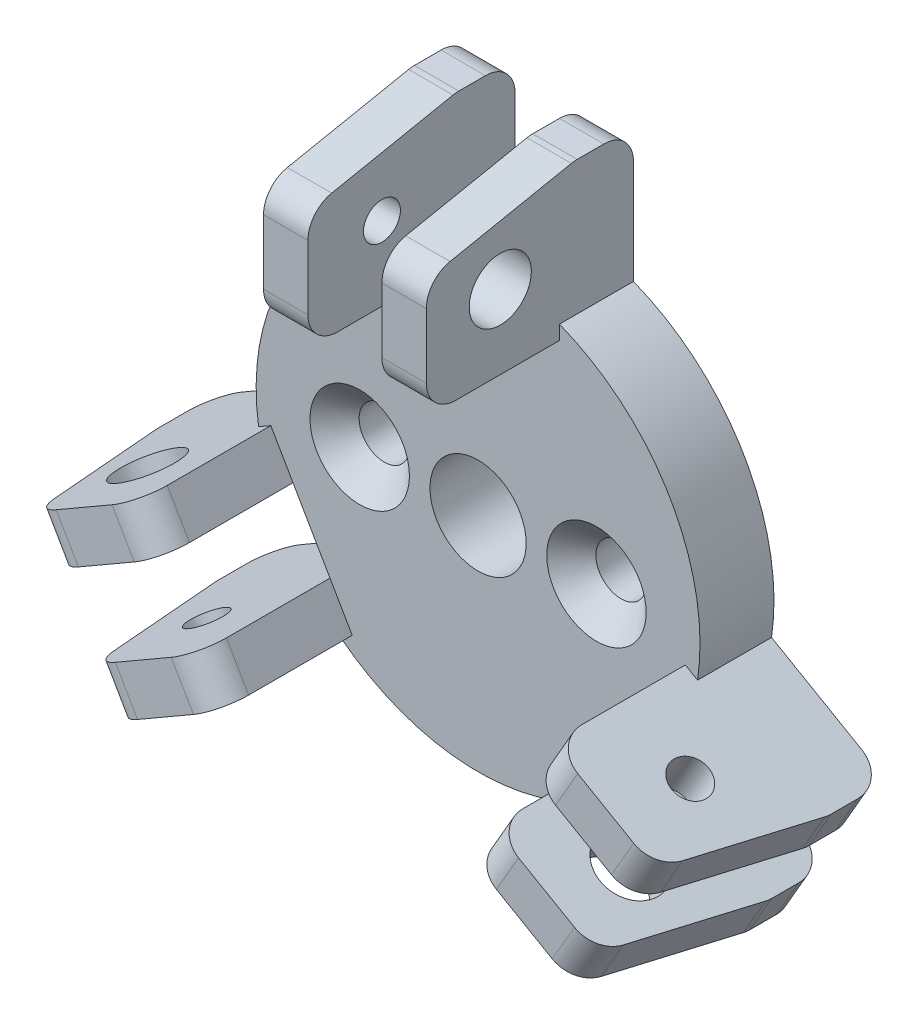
ISO-10303-21;
HEADER;
FILE_DESCRIPTION(('STEP AP214'),'2;1');
FILE_NAME('part.step','',(''),(''),'','','');
FILE_SCHEMA(('AUTOMOTIVE_DESIGN { 1 0 10303 214 1 1 1 1 }'));
ENDSEC;
DATA;
#1=APPLICATION_CONTEXT('core data for automotive mechanical design processes');
#2=APPLICATION_PROTOCOL_DEFINITION('international standard','automotive_design',2000,#1);
#3=PRODUCT_CONTEXT('',#1,'mechanical');
#4=PRODUCT('Part','Part','',(#3));
#5=PRODUCT_RELATED_PRODUCT_CATEGORY('part','',(#4));
#6=PRODUCT_DEFINITION_FORMATION('','',#4);
#7=PRODUCT_DEFINITION_CONTEXT('part definition',#1,'design');
#8=PRODUCT_DEFINITION('design','',#6,#7);
#9=PRODUCT_DEFINITION_SHAPE('','',#8);
#10=(LENGTH_UNIT() NAMED_UNIT(*) SI_UNIT(.MILLI.,.METRE.));
#11=(NAMED_UNIT(*) PLANE_ANGLE_UNIT() SI_UNIT($,.RADIAN.));
#12=(NAMED_UNIT(*) SI_UNIT($,.STERADIAN.) SOLID_ANGLE_UNIT());
#13=UNCERTAINTY_MEASURE_WITH_UNIT(LENGTH_MEASURE(1.E-05),#10,'distance_accuracy_value','');
#14=(GEOMETRIC_REPRESENTATION_CONTEXT(3) GLOBAL_UNCERTAINTY_ASSIGNED_CONTEXT((#13)) GLOBAL_UNIT_ASSIGNED_CONTEXT((#10,
#11,#12)) REPRESENTATION_CONTEXT('',''));
#15=CARTESIAN_POINT('',(0.,0.,0.));
#16=DIRECTION('',(0.,0.,1.));
#17=DIRECTION('',(1.,0.,0.));
#18=AXIS2_PLACEMENT_3D('',#15,#16,#17);
#19=CARTESIAN_POINT('',(-22.6685842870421,-6.73686027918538,0.));
#20=DIRECTION('',(-0.499999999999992,0.866025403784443,0.));
#21=DIRECTION('',(0.,0.,-1.));
#22=AXIS2_PLACEMENT_3D('',#19,#20,#21);
#23=PLANE('',#22);
#24=DIRECTION('',(-0.866025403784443,-0.499999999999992,0.));
#25=VECTOR('',#24,1.);
#26=CARTESIAN_POINT('',(-14.0083302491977,-1.73686027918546,0.));
#27=LINE('',#26,#25);
#28=CARTESIAN_POINT('',(-14.8356319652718,-2.21450314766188,0.));
#29=VERTEX_POINT('',#28);
#30=CARTESIAN_POINT('',(-20.9365334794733,-5.73686027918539,0.));
#31=VERTEX_POINT('',#30);
#32=EDGE_CURVE('E550',#29,#31,#27,.T.);
#33=ORIENTED_EDGE('',*,*,#32,.T.);
#34=CARTESIAN_POINT('',(-20.9365334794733,-5.73686027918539,2.));
#35=DIRECTION('',(-0.499999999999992,0.866025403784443,0.));
#36=DIRECTION('',(-0.866025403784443,-0.499999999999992,0.));
#37=AXIS2_PLACEMENT_3D('',#34,#35,#36);
#38=CIRCLE('',#37,2.);
#39=CARTESIAN_POINT('',(-22.6685842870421,-6.73686027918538,2.));
#40=VERTEX_POINT('',#39);
#41=EDGE_CURVE('E864',#31,#40,#38,.T.);
#42=ORIENTED_EDGE('',*,*,#41,.T.);
#43=DIRECTION('',(0.,0.,1.));
#44=VECTOR('',#43,1.);
#45=CARTESIAN_POINT('',(-22.6685842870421,-6.73686027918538,0.));
#46=LINE('',#45,#44);
#47=CARTESIAN_POINT('',(-22.6685842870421,-6.73686027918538,3.80196097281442));
#48=VERTEX_POINT('',#47);
#49=EDGE_CURVE('E553',#40,#48,#46,.T.);
#50=ORIENTED_EDGE('',*,*,#49,.T.);
#51=CARTESIAN_POINT('',(-20.9365334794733,-5.73686027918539,3.80196097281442));
#52=DIRECTION('',(-0.499999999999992,0.866025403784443,0.));
#53=DIRECTION('',(-0.866025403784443,-0.499999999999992,0.));
#54=AXIS2_PLACEMENT_3D('',#51,#52,#53);
#55=CIRCLE('',#54,2.);
#56=CARTESIAN_POINT('',(-22.6349490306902,-6.7174409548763,4.19419324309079));
#57=VERTEX_POINT('',#56);
#58=EDGE_CURVE('E862',#48,#57,#55,.T.);
#59=ORIENTED_EDGE('',*,*,#58,.T.);
#60=DIRECTION('',(0.16984155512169,0.0980580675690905,0.98058067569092));
#61=VECTOR('',#60,1.);
#62=CARTESIAN_POINT('',(-22.6685842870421,-6.73686027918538,4.));
#63=LINE('',#62,#61);
#64=CARTESIAN_POINT('',(-21.2150070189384,-5.89763705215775,12.3922322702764));
#65=VERTEX_POINT('',#64);
#66=EDGE_CURVE('E556',#57,#65,#63,.T.);
#67=ORIENTED_EDGE('',*,*,#66,.T.);
#68=CARTESIAN_POINT('',(-19.5165914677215,-4.91705637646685,12.));
#69=DIRECTION('',(-0.499999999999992,0.866025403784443,0.));
#70=DIRECTION('',(-0.866025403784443,-0.499999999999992,0.));
#71=AXIS2_PLACEMENT_3D('',#68,#69,#70);
#72=CIRCLE('',#71,2.);
#73=CARTESIAN_POINT('',(-19.5165914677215,-4.91705637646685,14.));
#74=VERTEX_POINT('',#73);
#75=EDGE_CURVE('E860',#65,#74,#72,.T.);
#76=ORIENTED_EDGE('',*,*,#75,.T.);
#77=DIRECTION('',(0.866025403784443,0.499999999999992,0.));
#78=VECTOR('',#77,1.);
#79=CARTESIAN_POINT('',(-14.0083302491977,-1.73686027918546,14.));
#80=LINE('',#79,#78);
#81=CARTESIAN_POINT('',(-15.7403810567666,-2.73686027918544,14.));
#82=VERTEX_POINT('',#81);
#83=EDGE_CURVE('E559',#74,#82,#80,.T.);
#84=ORIENTED_EDGE('',*,*,#83,.T.);
#85=CARTESIAN_POINT('',(-15.7403810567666,-2.73686027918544,12.));
#86=DIRECTION('',(-0.499999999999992,0.866025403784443,0.));
#87=DIRECTION('',(-0.866025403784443,-0.499999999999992,0.));
#88=AXIS2_PLACEMENT_3D('',#85,#86,#87);
#89=CIRCLE('',#88,2.);
#90=CARTESIAN_POINT('',(-14.0083302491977,-1.73686027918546,12.));
#91=VERTEX_POINT('',#90);
#92=EDGE_CURVE('E858',#82,#91,#89,.T.);
#93=ORIENTED_EDGE('',*,*,#92,.T.);
#94=DIRECTION('',(0.,0.,-1.));
#95=VECTOR('',#94,1.);
#96=CARTESIAN_POINT('',(-14.0083302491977,-1.73686027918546,0.));
#97=LINE('',#96,#95);
#98=CARTESIAN_POINT('',(-14.0083302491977,-1.73686027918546,5.));
#99=VERTEX_POINT('',#98);
#100=EDGE_CURVE('E562',#91,#99,#97,.T.);
#101=ORIENTED_EDGE('',*,*,#100,.T.);
#102=DIRECTION('',(-0.866025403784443,-0.499999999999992,0.));
#103=VECTOR('',#102,1.);
#104=CARTESIAN_POINT('',(-2.74999999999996,4.76313972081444,5.));
#105=LINE('',#104,#103);
#106=CARTESIAN_POINT('',(-14.8356319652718,-2.21450314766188,5.));
#107=VERTEX_POINT('',#106);
#108=EDGE_CURVE('E569',#99,#107,#105,.T.);
#109=ORIENTED_EDGE('',*,*,#108,.T.);
#110=DIRECTION('',(0.,0.,-1.));
#111=VECTOR('',#110,1.);
#112=CARTESIAN_POINT('',(-14.8356319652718,-2.21450314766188,5.));
#113=LINE('',#112,#111);
#114=EDGE_CURVE('E571',#29,#107,#113,.F.);
#115=ORIENTED_EDGE('',*,*,#114,.F.);
#116=EDGE_LOOP('',(#33,#42,#50,#59,#67,#76,#84,#93,#101,#109,#115));
#117=FACE_BOUND('',#116,.T.);
#118=CARTESIAN_POINT('',(-18.3384572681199,-4.23686027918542,9.));
#119=DIRECTION('',(-0.499999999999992,0.866025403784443,0.));
#120=DIRECTION('',(-0.866025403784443,-0.499999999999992,0.));
#121=AXIS2_PLACEMENT_3D('',#118,#119,#120);
#122=CIRCLE('',#121,2.1);
#123=CARTESIAN_POINT('',(-20.1571106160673,-5.2868602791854,9.));
#124=VERTEX_POINT('',#123);
#125=EDGE_CURVE('E893',#124,#124,#122,.F.);
#126=ORIENTED_EDGE('',*,*,#125,.T.);
#127=EDGE_LOOP('',(#126));
#128=FACE_BOUND('',#127,.T.);
#129=ADVANCED_FACE('F37',(#117,#128),#23,.T.);
#130=CARTESIAN_POINT('',(-21.1685842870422,-9.33493649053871,14.));
#131=DIRECTION('',(-0.499999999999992,0.866025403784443,0.));
#132=DIRECTION('',(-0.866025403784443,-0.499999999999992,0.));
#133=AXIS2_PLACEMENT_3D('',#130,#131,#132);
#134=PLANE('',#133);
#135=CARTESIAN_POINT('',(-19.4365334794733,-8.33493649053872,2.));
#136=DIRECTION('',(-0.499999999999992,0.866025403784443,0.));
#137=DIRECTION('',(-0.866025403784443,-0.499999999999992,0.));
#138=AXIS2_PLACEMENT_3D('',#135,#136,#137);
#139=CIRCLE('',#138,2.);
#140=CARTESIAN_POINT('',(-21.1685842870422,-9.33493649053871,2.));
#141=VERTEX_POINT('',#140);
#142=CARTESIAN_POINT('',(-19.4365334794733,-8.33493649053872,0.));
#143=VERTEX_POINT('',#142);
#144=EDGE_CURVE('E449',#141,#143,#139,.F.);
#145=ORIENTED_EDGE('',*,*,#144,.T.);
#146=DIRECTION('',(0.866025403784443,0.499999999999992,0.));
#147=VECTOR('',#146,1.);
#148=CARTESIAN_POINT('',(-21.1685842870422,-9.33493649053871,0.));
#149=LINE('',#148,#147);
#150=CARTESIAN_POINT('',(-12.5083302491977,-4.33493649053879,0.));
#151=VERTEX_POINT('',#150);
#152=EDGE_CURVE('E445',#143,#151,#149,.T.);
#153=ORIENTED_EDGE('',*,*,#152,.T.);
#154=DIRECTION('',(0.,0.,-1.));
#155=VECTOR('',#154,1.);
#156=CARTESIAN_POINT('',(-12.5083302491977,-4.33493649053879,14.));
#157=LINE('',#156,#155);
#158=CARTESIAN_POINT('',(-12.5083302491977,-4.33493649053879,5.));
#159=VERTEX_POINT('',#158);
#160=EDGE_CURVE('E434',#159,#151,#157,.T.);
#161=ORIENTED_EDGE('',*,*,#160,.F.);
#162=CARTESIAN_POINT('',(-12.5083302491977,-4.33493649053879,12.));
#163=VERTEX_POINT('',#162);
#164=EDGE_CURVE('E54',#163,#159,#157,.T.);
#165=ORIENTED_EDGE('',*,*,#164,.F.);
#166=CARTESIAN_POINT('',(-14.2403810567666,-5.33493649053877,12.));
#167=DIRECTION('',(-0.499999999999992,0.866025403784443,0.));
#168=DIRECTION('',(-0.866025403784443,-0.499999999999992,0.));
#169=AXIS2_PLACEMENT_3D('',#166,#167,#168);
#170=CIRCLE('',#169,2.);
#171=CARTESIAN_POINT('',(-14.2403810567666,-5.33493649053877,14.));
#172=VERTEX_POINT('',#171);
#173=EDGE_CURVE('E46',#163,#172,#170,.F.);
#174=ORIENTED_EDGE('',*,*,#173,.T.);
#175=DIRECTION('',(0.866025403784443,0.499999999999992,0.));
#176=VECTOR('',#175,1.);
#177=CARTESIAN_POINT('',(-21.1685842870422,-9.33493649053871,14.));
#178=LINE('',#177,#176);
#179=CARTESIAN_POINT('',(-18.0165914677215,-7.51513258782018,14.));
#180=VERTEX_POINT('',#179);
#181=EDGE_CURVE('E460',#180,#172,#178,.T.);
#182=ORIENTED_EDGE('',*,*,#181,.F.);
#183=CARTESIAN_POINT('',(-18.0165914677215,-7.51513258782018,12.));
#184=DIRECTION('',(-0.499999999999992,0.866025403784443,0.));
#185=DIRECTION('',(-0.866025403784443,-0.499999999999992,0.));
#186=AXIS2_PLACEMENT_3D('',#183,#184,#185);
#187=CIRCLE('',#186,2.);
#188=CARTESIAN_POINT('',(-19.7150070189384,-8.49571326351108,12.3922322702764));
#189=VERTEX_POINT('',#188);
#190=EDGE_CURVE('E473',#180,#189,#187,.F.);
#191=ORIENTED_EDGE('',*,*,#190,.T.);
#192=DIRECTION('',(0.16984155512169,0.0980580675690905,0.98058067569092));
#193=VECTOR('',#192,1.);
#194=CARTESIAN_POINT('',(-21.1685842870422,-9.33493649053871,4.));
#195=LINE('',#194,#193);
#196=CARTESIAN_POINT('',(-21.1349490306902,-9.31551716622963,4.19419324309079));
#197=VERTEX_POINT('',#196);
#198=EDGE_CURVE('E475',#197,#189,#195,.T.);
#199=ORIENTED_EDGE('',*,*,#198,.F.);
#200=CARTESIAN_POINT('',(-19.4365334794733,-8.33493649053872,3.80196097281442));
#201=DIRECTION('',(-0.499999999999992,0.866025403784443,0.));
#202=DIRECTION('',(-0.866025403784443,-0.499999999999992,0.));
#203=AXIS2_PLACEMENT_3D('',#200,#201,#202);
#204=CIRCLE('',#203,2.);
#205=CARTESIAN_POINT('',(-21.1685842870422,-9.33493649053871,3.80196097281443));
#206=VERTEX_POINT('',#205);
#207=EDGE_CURVE('E478',#197,#206,#204,.F.);
#208=ORIENTED_EDGE('',*,*,#207,.T.);
#209=DIRECTION('',(0.,0.,-1.));
#210=VECTOR('',#209,1.);
#211=CARTESIAN_POINT('',(-21.1685842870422,-9.33493649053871,14.));
#212=LINE('',#211,#210);
#213=EDGE_CURVE('E442',#206,#141,#212,.T.);
#214=ORIENTED_EDGE('',*,*,#213,.T.);
#215=EDGE_LOOP('',(#145,#153,#161,#165,#174,#182,#191,#199,#208,#214));
#216=FACE_BOUND('',#215,.T.);
#217=CARTESIAN_POINT('',(-16.83845726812,-6.83493649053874,9.));
#218=DIRECTION('',(-0.499999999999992,0.866025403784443,0.));
#219=DIRECTION('',(-0.866025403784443,-0.499999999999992,0.));
#220=AXIS2_PLACEMENT_3D('',#217,#218,#219);
#221=CIRCLE('',#220,2.1);
#222=CARTESIAN_POINT('',(-18.6571106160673,-7.88493649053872,9.));
#223=VERTEX_POINT('',#222);
#224=EDGE_CURVE('E41',#223,#223,#221,.F.);
#225=ORIENTED_EDGE('',*,*,#224,.F.);
#226=EDGE_LOOP('',(#225));
#227=FACE_BOUND('',#226,.T.);
#228=ADVANCED_FACE('F446',(#216,#227),#134,.F.);
#229=CARTESIAN_POINT('',(17.168584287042,-16.2631397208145,0.));
#230=DIRECTION('',(-0.500000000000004,-0.866025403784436,0.));
#231=DIRECTION('',(0.,0.,-1.));
#232=AXIS2_PLACEMENT_3D('',#229,#230,#231);
#233=PLANE('',#232);
#234=DIRECTION('',(0.866025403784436,-0.500000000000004,0.));
#235=VECTOR('',#234,1.);
#236=CARTESIAN_POINT('',(8.50833024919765,-11.2631397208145,0.));
#237=LINE('',#236,#235);
#238=CARTESIAN_POINT('',(9.33563196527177,-11.7407825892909,0.));
#239=VERTEX_POINT('',#238);
#240=CARTESIAN_POINT('',(15.4365334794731,-15.2631397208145,0.));
#241=VERTEX_POINT('',#240);
#242=EDGE_CURVE('E593',#239,#241,#237,.T.);
#243=ORIENTED_EDGE('',*,*,#242,.T.);
#244=CARTESIAN_POINT('',(15.4365334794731,-15.2631397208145,2.));
#245=DIRECTION('',(-0.500000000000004,-0.866025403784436,0.));
#246=DIRECTION('',(0.866025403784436,-0.500000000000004,0.));
#247=AXIS2_PLACEMENT_3D('',#244,#245,#246);
#248=CIRCLE('',#247,2.);
#249=CARTESIAN_POINT('',(17.168584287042,-16.2631397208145,2.));
#250=VERTEX_POINT('',#249);
#251=EDGE_CURVE('E817',#241,#250,#248,.T.);
#252=ORIENTED_EDGE('',*,*,#251,.T.);
#253=DIRECTION('',(0.,0.,1.));
#254=VECTOR('',#253,1.);
#255=CARTESIAN_POINT('',(17.168584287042,-16.2631397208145,0.));
#256=LINE('',#255,#254);
#257=CARTESIAN_POINT('',(17.168584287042,-16.2631397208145,3.80196097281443));
#258=VERTEX_POINT('',#257);
#259=EDGE_CURVE('E596',#250,#258,#256,.T.);
#260=ORIENTED_EDGE('',*,*,#259,.T.);
#261=CARTESIAN_POINT('',(15.4365334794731,-15.2631397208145,3.80196097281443));
#262=DIRECTION('',(-0.500000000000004,-0.866025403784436,0.));
#263=DIRECTION('',(0.866025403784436,-0.500000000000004,0.));
#264=AXIS2_PLACEMENT_3D('',#261,#262,#263);
#265=CIRCLE('',#264,2.);
#266=CARTESIAN_POINT('',(17.13494903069,-16.2437203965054,4.1941932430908));
#267=VERTEX_POINT('',#266);
#268=EDGE_CURVE('E815',#258,#267,#265,.T.);
#269=ORIENTED_EDGE('',*,*,#268,.T.);
#270=DIRECTION('',(-0.169841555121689,0.0980580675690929,0.98058067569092));
#271=VECTOR('',#270,1.);
#272=CARTESIAN_POINT('',(17.168584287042,-16.2631397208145,4.));
#273=LINE('',#272,#271);
#274=CARTESIAN_POINT('',(15.7150070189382,-15.4239164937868,12.3922322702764));
#275=VERTEX_POINT('',#274);
#276=EDGE_CURVE('E599',#267,#275,#273,.T.);
#277=ORIENTED_EDGE('',*,*,#276,.T.);
#278=CARTESIAN_POINT('',(14.0165914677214,-14.4433358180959,12.));
#279=DIRECTION('',(-0.500000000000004,-0.866025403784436,0.));
#280=DIRECTION('',(0.866025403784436,-0.500000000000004,0.));
#281=AXIS2_PLACEMENT_3D('',#278,#279,#280);
#282=CIRCLE('',#281,2.);
#283=CARTESIAN_POINT('',(14.0165914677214,-14.4433358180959,14.));
#284=VERTEX_POINT('',#283);
#285=EDGE_CURVE('E813',#275,#284,#282,.T.);
#286=ORIENTED_EDGE('',*,*,#285,.T.);
#287=DIRECTION('',(-0.866025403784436,0.500000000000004,0.));
#288=VECTOR('',#287,1.);
#289=CARTESIAN_POINT('',(8.50833024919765,-11.2631397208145,14.));
#290=LINE('',#289,#288);
#291=CARTESIAN_POINT('',(10.2403810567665,-12.2631397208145,14.));
#292=VERTEX_POINT('',#291);
#293=EDGE_CURVE('E602',#284,#292,#290,.T.);
#294=ORIENTED_EDGE('',*,*,#293,.T.);
#295=CARTESIAN_POINT('',(10.2403810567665,-12.2631397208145,12.));
#296=DIRECTION('',(-0.500000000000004,-0.866025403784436,0.));
#297=DIRECTION('',(0.866025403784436,-0.500000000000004,0.));
#298=AXIS2_PLACEMENT_3D('',#295,#296,#297);
#299=CIRCLE('',#298,2.);
#300=CARTESIAN_POINT('',(8.50833024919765,-11.2631397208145,12.));
#301=VERTEX_POINT('',#300);
#302=EDGE_CURVE('E811',#292,#301,#299,.T.);
#303=ORIENTED_EDGE('',*,*,#302,.T.);
#304=DIRECTION('',(0.,0.,-1.));
#305=VECTOR('',#304,1.);
#306=CARTESIAN_POINT('',(8.50833024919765,-11.2631397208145,0.));
#307=LINE('',#306,#305);
#308=CARTESIAN_POINT('',(8.50833024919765,-11.2631397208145,5.));
#309=VERTEX_POINT('',#308);
#310=EDGE_CURVE('E605',#301,#309,#307,.T.);
#311=ORIENTED_EDGE('',*,*,#310,.T.);
#312=DIRECTION('',(0.866025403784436,-0.500000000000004,0.));
#313=VECTOR('',#312,1.);
#314=CARTESIAN_POINT('',(-2.75000000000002,-4.7631397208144,5.));
#315=LINE('',#314,#313);
#316=CARTESIAN_POINT('',(9.33563196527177,-11.7407825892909,5.));
#317=VERTEX_POINT('',#316);
#318=EDGE_CURVE('E612',#309,#317,#315,.T.);
#319=ORIENTED_EDGE('',*,*,#318,.T.);
#320=DIRECTION('',(0.,0.,-1.));
#321=VECTOR('',#320,1.);
#322=CARTESIAN_POINT('',(9.33563196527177,-11.7407825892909,5.));
#323=LINE('',#322,#321);
#324=EDGE_CURVE('E615',#239,#317,#323,.F.);
#325=ORIENTED_EDGE('',*,*,#324,.F.);
#326=EDGE_LOOP('',(#243,#252,#260,#269,#277,#286,#294,#303,#311,#319,#325));
#327=FACE_BOUND('',#326,.T.);
#328=CARTESIAN_POINT('',(12.8384572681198,-13.7631397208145,9.));
#329=DIRECTION('',(-0.500000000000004,-0.866025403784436,0.));
#330=DIRECTION('',(0.866025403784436,-0.500000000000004,0.));
#331=AXIS2_PLACEMENT_3D('',#328,#329,#330);
#332=CIRCLE('',#331,2.1);
#333=CARTESIAN_POINT('',(14.6571106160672,-14.8131397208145,9.));
#334=VERTEX_POINT('',#333);
#335=EDGE_CURVE('E892',#334,#334,#332,.F.);
#336=ORIENTED_EDGE('',*,*,#335,.T.);
#337=EDGE_LOOP('',(#336));
#338=FACE_BOUND('',#337,.T.);
#339=ADVANCED_FACE('F1129',(#327,#338),#233,.T.);
#340=CARTESIAN_POINT('',(18.668584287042,-13.6650635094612,14.));
#341=DIRECTION('',(-0.500000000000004,-0.866025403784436,0.));
#342=DIRECTION('',(0.866025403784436,-0.500000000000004,0.));
#343=AXIS2_PLACEMENT_3D('',#340,#341,#342);
#344=PLANE('',#343);
#345=CARTESIAN_POINT('',(16.9365334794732,-12.6650635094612,2.));
#346=DIRECTION('',(-0.500000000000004,-0.866025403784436,0.));
#347=DIRECTION('',(0.866025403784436,-0.500000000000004,0.));
#348=AXIS2_PLACEMENT_3D('',#345,#346,#347);
#349=CIRCLE('',#348,2.);
#350=CARTESIAN_POINT('',(18.668584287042,-13.6650635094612,2.));
#351=VERTEX_POINT('',#350);
#352=CARTESIAN_POINT('',(16.9365334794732,-12.6650635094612,0.));
#353=VERTEX_POINT('',#352);
#354=EDGE_CURVE('E522',#351,#353,#349,.F.);
#355=ORIENTED_EDGE('',*,*,#354,.T.);
#356=DIRECTION('',(-0.866025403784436,0.500000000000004,0.));
#357=VECTOR('',#356,1.);
#358=CARTESIAN_POINT('',(18.668584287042,-13.6650635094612,0.));
#359=LINE('',#358,#357);
#360=CARTESIAN_POINT('',(10.0083302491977,-8.66506350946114,0.));
#361=VERTEX_POINT('',#360);
#362=EDGE_CURVE('E493',#353,#361,#359,.T.);
#363=ORIENTED_EDGE('',*,*,#362,.T.);
#364=DIRECTION('',(0.,0.,-1.));
#365=VECTOR('',#364,1.);
#366=CARTESIAN_POINT('',(10.0083302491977,-8.66506350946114,14.));
#367=LINE('',#366,#365);
#368=CARTESIAN_POINT('',(10.0083302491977,-8.66506350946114,5.));
#369=VERTEX_POINT('',#368);
#370=EDGE_CURVE('E509',#369,#361,#367,.T.);
#371=ORIENTED_EDGE('',*,*,#370,.F.);
#372=CARTESIAN_POINT('',(10.0083302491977,-8.66506350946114,12.));
#373=VERTEX_POINT('',#372);
#374=EDGE_CURVE('E62',#373,#369,#367,.T.);
#375=ORIENTED_EDGE('',*,*,#374,.F.);
#376=CARTESIAN_POINT('',(11.7403810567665,-9.66506350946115,12.));
#377=DIRECTION('',(-0.500000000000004,-0.866025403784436,0.));
#378=DIRECTION('',(0.866025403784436,-0.500000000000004,0.));
#379=AXIS2_PLACEMENT_3D('',#376,#377,#378);
#380=CIRCLE('',#379,2.);
#381=CARTESIAN_POINT('',(11.7403810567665,-9.66506350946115,14.));
#382=VERTEX_POINT('',#381);
#383=EDGE_CURVE('E886',#373,#382,#380,.F.);
#384=ORIENTED_EDGE('',*,*,#383,.T.);
#385=DIRECTION('',(-0.866025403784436,0.500000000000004,0.));
#386=VECTOR('',#385,1.);
#387=CARTESIAN_POINT('',(18.668584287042,-13.6650635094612,14.));
#388=LINE('',#387,#386);
#389=CARTESIAN_POINT('',(15.5165914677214,-11.8452596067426,14.));
#390=VERTEX_POINT('',#389);
#391=EDGE_CURVE('E502',#390,#382,#388,.T.);
#392=ORIENTED_EDGE('',*,*,#391,.F.);
#393=CARTESIAN_POINT('',(15.5165914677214,-11.8452596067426,12.));
#394=DIRECTION('',(-0.500000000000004,-0.866025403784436,0.));
#395=DIRECTION('',(0.866025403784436,-0.500000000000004,0.));
#396=AXIS2_PLACEMENT_3D('',#393,#394,#395);
#397=CIRCLE('',#396,2.);
#398=CARTESIAN_POINT('',(17.2150070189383,-12.8258402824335,12.3922322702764));
#399=VERTEX_POINT('',#398);
#400=EDGE_CURVE('E515',#390,#399,#397,.F.);
#401=ORIENTED_EDGE('',*,*,#400,.T.);
#402=DIRECTION('',(-0.169841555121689,0.0980580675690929,0.98058067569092));
#403=VECTOR('',#402,1.);
#404=CARTESIAN_POINT('',(18.668584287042,-13.6650635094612,4.));
#405=LINE('',#404,#403);
#406=CARTESIAN_POINT('',(18.63494903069,-13.6456441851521,4.1941932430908));
#407=VERTEX_POINT('',#406);
#408=EDGE_CURVE('E517',#407,#399,#405,.T.);
#409=ORIENTED_EDGE('',*,*,#408,.F.);
#410=CARTESIAN_POINT('',(16.9365334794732,-12.6650635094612,3.80196097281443));
#411=DIRECTION('',(-0.500000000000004,-0.866025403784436,0.));
#412=DIRECTION('',(0.866025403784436,-0.500000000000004,0.));
#413=AXIS2_PLACEMENT_3D('',#410,#411,#412);
#414=CIRCLE('',#413,2.);
#415=CARTESIAN_POINT('',(18.668584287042,-13.6650635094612,3.80196097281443));
#416=VERTEX_POINT('',#415);
#417=EDGE_CURVE('E520',#407,#416,#414,.F.);
#418=ORIENTED_EDGE('',*,*,#417,.T.);
#419=DIRECTION('',(0.,0.,-1.));
#420=VECTOR('',#419,1.);
#421=CARTESIAN_POINT('',(18.668584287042,-13.6650635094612,14.));
#422=LINE('',#421,#420);
#423=EDGE_CURVE('E511',#416,#351,#422,.T.);
#424=ORIENTED_EDGE('',*,*,#423,.T.);
#425=EDGE_LOOP('',(#355,#363,#371,#375,#384,#392,#401,#409,#418,#424));
#426=FACE_BOUND('',#425,.T.);
#427=CARTESIAN_POINT('',(14.3384572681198,-11.1650635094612,9.));
#428=DIRECTION('',(-0.500000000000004,-0.866025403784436,0.));
#429=DIRECTION('',(0.866025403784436,-0.500000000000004,0.));
#430=AXIS2_PLACEMENT_3D('',#427,#428,#429);
#431=CIRCLE('',#430,2.1);
#432=CARTESIAN_POINT('',(16.1571106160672,-12.2150635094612,9.));
#433=VERTEX_POINT('',#432);
#434=EDGE_CURVE('E890',#433,#433,#431,.F.);
#435=ORIENTED_EDGE('',*,*,#434,.F.);
#436=EDGE_LOOP('',(#435));
#437=FACE_BOUND('',#436,.T.);
#438=ADVANCED_FACE('F1122',(#426,#437),#344,.F.);
#439=CARTESIAN_POINT('',(-22.6685842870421,-6.73686027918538,0.));
#440=DIRECTION('',(0.866025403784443,0.499999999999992,0.));
#441=DIRECTION('',(-0.499999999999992,0.866025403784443,0.));
#442=AXIS2_PLACEMENT_3D('',#439,#440,#441);
#443=PLANE('',#442);
#444=DIRECTION('',(0.499999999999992,-0.866025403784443,0.));
#445=VECTOR('',#444,1.);
#446=CARTESIAN_POINT('',(-22.6685842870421,-6.73686027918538,3.80196097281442));
#447=LINE('',#446,#445);
#448=CARTESIAN_POINT('',(-17.1685842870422,-16.2631397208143,3.80196097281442));
#449=VERTEX_POINT('',#448);
#450=CARTESIAN_POINT('',(-18.6685842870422,-13.6650635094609,3.80196097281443));
#451=VERTEX_POINT('',#450);
#452=EDGE_CURVE('E840',#449,#451,#447,.F.);
#453=ORIENTED_EDGE('',*,*,#452,.T.);
#454=DIRECTION('',(0.,0.,-1.));
#455=VECTOR('',#454,1.);
#456=CARTESIAN_POINT('',(-18.6685842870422,-13.6650635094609,14.));
#457=LINE('',#456,#455);
#458=CARTESIAN_POINT('',(-18.6685842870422,-13.6650635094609,2.));
#459=VERTEX_POINT('',#458);
#460=EDGE_CURVE('E466',#451,#459,#457,.T.);
#461=ORIENTED_EDGE('',*,*,#460,.T.);
#462=DIRECTION('',(0.499999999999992,-0.866025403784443,0.));
#463=VECTOR('',#462,1.);
#464=CARTESIAN_POINT('',(-22.6685842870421,-6.73686027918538,2.));
#465=LINE('',#464,#463);
#466=CARTESIAN_POINT('',(-17.1685842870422,-16.2631397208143,2.));
#467=VERTEX_POINT('',#466);
#468=EDGE_CURVE('E843',#459,#467,#465,.T.);
#469=ORIENTED_EDGE('',*,*,#468,.T.);
#470=DIRECTION('',(0.,0.,1.));
#471=VECTOR('',#470,1.);
#472=CARTESIAN_POINT('',(-17.1685842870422,-16.2631397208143,0.));
#473=LINE('',#472,#471);
#474=EDGE_CURVE('E538',#467,#449,#473,.T.);
#475=ORIENTED_EDGE('',*,*,#474,.T.);
#476=EDGE_LOOP('',(#453,#461,#469,#475));
#477=FACE_BOUND('',#476,.T.);
#478=ADVANCED_FACE('F1120',(#477),#443,.F.);
#479=CARTESIAN_POINT('',(-22.6685842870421,-6.73686027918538,4.));
#480=DIRECTION('',(0.849207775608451,0.490290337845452,-0.196116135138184));
#481=DIRECTION('',(-0.499999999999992,0.866025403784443,0.));
#482=AXIS2_PLACEMENT_3D('',#479,#480,#481);
#483=PLANE('',#482);
#484=DIRECTION('',(0.499999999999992,-0.866025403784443,0.));
#485=VECTOR('',#484,1.);
#486=CARTESIAN_POINT('',(-21.2150070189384,-5.89763705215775,12.3922322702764));
#487=LINE('',#486,#485);
#488=CARTESIAN_POINT('',(-15.7150070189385,-15.4239164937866,12.3922322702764));
#489=VERTEX_POINT('',#488);
#490=CARTESIAN_POINT('',(-17.2150070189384,-12.8258402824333,12.3922322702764));
#491=VERTEX_POINT('',#490);
#492=EDGE_CURVE('E867',#489,#491,#487,.F.);
#493=ORIENTED_EDGE('',*,*,#492,.T.);
#494=DIRECTION('',(-0.16984155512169,-0.0980580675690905,-0.98058067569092));
#495=VECTOR('',#494,1.);
#496=CARTESIAN_POINT('',(-18.6685842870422,-13.6650635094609,4.));
#497=LINE('',#496,#495);
#498=CARTESIAN_POINT('',(-18.6349490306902,-13.6456441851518,4.19419324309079));
#499=VERTEX_POINT('',#498);
#500=EDGE_CURVE('E484',#491,#499,#497,.T.);
#501=ORIENTED_EDGE('',*,*,#500,.T.);
#502=DIRECTION('',(0.499999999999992,-0.866025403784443,0.));
#503=VECTOR('',#502,1.);
#504=CARTESIAN_POINT('',(-22.6349490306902,-6.7174409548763,4.19419324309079));
#505=LINE('',#504,#503);
#506=CARTESIAN_POINT('',(-17.1349490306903,-16.2437203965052,4.19419324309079));
#507=VERTEX_POINT('',#506);
#508=EDGE_CURVE('E870',#499,#507,#505,.T.);
#509=ORIENTED_EDGE('',*,*,#508,.T.);
#510=DIRECTION('',(0.16984155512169,0.0980580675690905,0.98058067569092));
#511=VECTOR('',#510,1.);
#512=CARTESIAN_POINT('',(-17.1685842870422,-16.2631397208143,4.));
#513=LINE('',#512,#511);
#514=EDGE_CURVE('E541',#507,#489,#513,.T.);
#515=ORIENTED_EDGE('',*,*,#514,.T.);
#516=EDGE_LOOP('',(#493,#501,#509,#515));
#517=FACE_BOUND('',#516,.T.);
#518=ADVANCED_FACE('F1112',(#517),#483,.F.);
#519=CARTESIAN_POINT('',(-14.0083302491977,-1.73686027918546,14.));
#520=DIRECTION('',(0.,0.,-1.));
#521=DIRECTION('',(-1.,0.,0.));
#522=AXIS2_PLACEMENT_3D('',#519,#520,#521);
#523=PLANE('',#522);
#524=DIRECTION('',(0.499999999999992,-0.866025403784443,0.));
#525=VECTOR('',#524,1.);
#526=CARTESIAN_POINT('',(-15.7403810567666,-2.73686027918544,14.));
#527=LINE('',#526,#525);
#528=CARTESIAN_POINT('',(-10.2403810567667,-12.2631397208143,14.));
#529=VERTEX_POINT('',#528);
#530=CARTESIAN_POINT('',(-11.7403810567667,-9.66506350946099,14.));
#531=VERTEX_POINT('',#530);
#532=EDGE_CURVE('E875',#529,#531,#527,.F.);
#533=ORIENTED_EDGE('',*,*,#532,.T.);
#534=DIRECTION('',(-0.866025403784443,-0.499999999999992,0.));
#535=VECTOR('',#534,1.);
#536=CARTESIAN_POINT('',(-18.6685842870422,-13.6650635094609,14.));
#537=LINE('',#536,#535);
#538=CARTESIAN_POINT('',(-15.5165914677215,-11.8452596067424,14.));
#539=VERTEX_POINT('',#538);
#540=EDGE_CURVE('E457',#531,#539,#537,.T.);
#541=ORIENTED_EDGE('',*,*,#540,.T.);
#542=DIRECTION('',(0.499999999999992,-0.866025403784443,0.));
#543=VECTOR('',#542,1.);
#544=CARTESIAN_POINT('',(-19.5165914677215,-4.91705637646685,14.));
#545=LINE('',#544,#543);
#546=CARTESIAN_POINT('',(-14.0165914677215,-14.4433358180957,14.));
#547=VERTEX_POINT('',#546);
#548=EDGE_CURVE('E878',#539,#547,#545,.T.);
#549=ORIENTED_EDGE('',*,*,#548,.T.);
#550=DIRECTION('',(0.866025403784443,0.499999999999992,0.));
#551=VECTOR('',#550,1.);
#552=CARTESIAN_POINT('',(-8.5083302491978,-11.2631397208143,14.));
#553=LINE('',#552,#551);
#554=EDGE_CURVE('E544',#547,#529,#553,.T.);
#555=ORIENTED_EDGE('',*,*,#554,.T.);
#556=EDGE_LOOP('',(#533,#541,#549,#555));
#557=FACE_BOUND('',#556,.T.);
#558=ADVANCED_FACE('F1101',(#557),#523,.F.);
#559=CARTESIAN_POINT('',(-14.0083302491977,-1.73686027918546,0.));
#560=DIRECTION('',(-0.866025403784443,-0.499999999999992,0.));
#561=DIRECTION('',(0.499999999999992,-0.866025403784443,0.));
#562=AXIS2_PLACEMENT_3D('',#559,#560,#561);
#563=PLANE('',#562);
#564=DIRECTION('',(0.499999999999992,-0.866025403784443,0.));
#565=VECTOR('',#564,1.);
#566=CARTESIAN_POINT('',(-11.2583302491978,-6.49999999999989,5.));
#567=LINE('',#566,#565);
#568=CARTESIAN_POINT('',(-10.0083302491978,-8.665063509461,5.));
#569=VERTEX_POINT('',#568);
#570=CARTESIAN_POINT('',(-8.5083302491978,-11.2631397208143,5.));
#571=VERTEX_POINT('',#570);
#572=EDGE_CURVE('E574',#569,#571,#567,.T.);
#573=ORIENTED_EDGE('',*,*,#572,.F.);
#574=DIRECTION('',(0.,0.,-1.));
#575=VECTOR('',#574,1.);
#576=CARTESIAN_POINT('',(-10.0083302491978,-8.665063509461,14.));
#577=LINE('',#576,#575);
#578=CARTESIAN_POINT('',(-10.0083302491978,-8.665063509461,12.));
#579=VERTEX_POINT('',#578);
#580=EDGE_CURVE('E468',#579,#569,#577,.T.);
#581=ORIENTED_EDGE('',*,*,#580,.F.);
#582=DIRECTION('',(0.499999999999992,-0.866025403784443,0.));
#583=VECTOR('',#582,1.);
#584=CARTESIAN_POINT('',(-14.0083302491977,-1.73686027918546,12.));
#585=LINE('',#584,#583);
#586=CARTESIAN_POINT('',(-8.5083302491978,-11.2631397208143,12.));
#587=VERTEX_POINT('',#586);
#588=EDGE_CURVE('E882',#579,#587,#585,.T.);
#589=ORIENTED_EDGE('',*,*,#588,.T.);
#590=DIRECTION('',(0.,0.,-1.));
#591=VECTOR('',#590,1.);
#592=CARTESIAN_POINT('',(-8.5083302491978,-11.2631397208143,0.));
#593=LINE('',#592,#591);
#594=EDGE_CURVE('E547',#587,#571,#593,.T.);
#595=ORIENTED_EDGE('',*,*,#594,.T.);
#596=EDGE_LOOP('',(#573,#581,#589,#595));
#597=FACE_BOUND('',#596,.T.);
#598=ADVANCED_FACE('F1094',(#597),#563,.F.);
#599=CARTESIAN_POINT('',(-20.9365334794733,-5.73686027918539,2.));
#600=DIRECTION('',(0.499999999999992,-0.866025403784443,0.));
#601=DIRECTION('',(0.866025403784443,0.499999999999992,0.));
#602=AXIS2_PLACEMENT_3D('',#599,#600,#601);
#603=CYLINDRICAL_SURFACE('',#602,2.);
#604=CARTESIAN_POINT('',(-16.9365334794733,-12.6650635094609,2.));
#605=DIRECTION('',(0.499999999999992,-0.866025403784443,0.));
#606=DIRECTION('',(0.866025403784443,0.499999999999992,0.));
#607=AXIS2_PLACEMENT_3D('',#604,#605,#606);
#608=CIRCLE('',#607,2.);
#609=CARTESIAN_POINT('',(-16.9365334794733,-12.6650635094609,0.));
#610=VERTEX_POINT('',#609);
#611=EDGE_CURVE('E489',#610,#459,#608,.F.);
#612=ORIENTED_EDGE('',*,*,#611,.F.);
#613=DIRECTION('',(0.499999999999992,-0.866025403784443,0.));
#614=VECTOR('',#613,1.);
#615=CARTESIAN_POINT('',(-18.1865334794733,-10.4999999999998,0.));
#616=LINE('',#615,#614);
#617=CARTESIAN_POINT('',(-15.4365334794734,-15.2631397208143,0.));
#618=VERTEX_POINT('',#617);
#619=EDGE_CURVE('E856',#618,#610,#616,.F.);
#620=ORIENTED_EDGE('',*,*,#619,.F.);
#621=CARTESIAN_POINT('',(-15.4365334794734,-15.2631397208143,2.));
#622=DIRECTION('',(-0.499999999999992,0.866025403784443,0.));
#623=DIRECTION('',(-0.866025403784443,-0.499999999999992,0.));
#624=AXIS2_PLACEMENT_3D('',#621,#622,#623);
#625=CIRCLE('',#624,2.);
#626=EDGE_CURVE('E853',#467,#618,#625,.F.);
#627=ORIENTED_EDGE('',*,*,#626,.F.);
#628=ORIENTED_EDGE('',*,*,#468,.F.);
#629=EDGE_LOOP('',(#612,#620,#627,#628));
#630=FACE_BOUND('',#629,.T.);
#631=ADVANCED_FACE('F925',(#630),#603,.T.);
#632=CARTESIAN_POINT('',(-20.9365334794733,-5.73686027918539,3.80196097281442));
#633=DIRECTION('',(0.499999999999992,-0.866025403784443,0.));
#634=DIRECTION('',(0.866025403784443,0.499999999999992,0.));
#635=AXIS2_PLACEMENT_3D('',#632,#633,#634);
#636=CYLINDRICAL_SURFACE('',#635,2.);
#637=CARTESIAN_POINT('',(-16.9365334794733,-12.6650635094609,3.80196097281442));
#638=DIRECTION('',(0.499999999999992,-0.866025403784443,0.));
#639=DIRECTION('',(0.866025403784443,0.499999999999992,0.));
#640=AXIS2_PLACEMENT_3D('',#637,#638,#639);
#641=CIRCLE('',#640,2.);
#642=EDGE_CURVE('E487',#451,#499,#641,.F.);
#643=ORIENTED_EDGE('',*,*,#642,.F.);
#644=ORIENTED_EDGE('',*,*,#452,.F.);
#645=CARTESIAN_POINT('',(-15.4365334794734,-15.2631397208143,3.80196097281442));
#646=DIRECTION('',(-0.499999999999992,0.866025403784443,0.));
#647=DIRECTION('',(-0.866025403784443,-0.499999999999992,0.));
#648=AXIS2_PLACEMENT_3D('',#645,#646,#647);
#649=CIRCLE('',#648,2.);
#650=EDGE_CURVE('E851',#507,#449,#649,.F.);
#651=ORIENTED_EDGE('',*,*,#650,.F.);
#652=ORIENTED_EDGE('',*,*,#508,.F.);
#653=EDGE_LOOP('',(#643,#644,#651,#652));
#654=FACE_BOUND('',#653,.T.);
#655=ADVANCED_FACE('F1118',(#654),#636,.T.);
#656=CARTESIAN_POINT('',(-19.5165914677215,-4.91705637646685,12.));
#657=DIRECTION('',(0.499999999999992,-0.866025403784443,0.));
#658=DIRECTION('',(0.866025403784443,0.499999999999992,0.));
#659=AXIS2_PLACEMENT_3D('',#656,#657,#658);
#660=CYLINDRICAL_SURFACE('',#659,2.);
#661=CARTESIAN_POINT('',(-15.5165914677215,-11.8452596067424,12.));
#662=DIRECTION('',(0.499999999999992,-0.866025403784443,0.));
#663=DIRECTION('',(0.866025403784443,0.499999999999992,0.));
#664=AXIS2_PLACEMENT_3D('',#661,#662,#663);
#665=CIRCLE('',#664,2.);
#666=EDGE_CURVE('E482',#491,#539,#665,.F.);
#667=ORIENTED_EDGE('',*,*,#666,.F.);
#668=ORIENTED_EDGE('',*,*,#492,.F.);
#669=CARTESIAN_POINT('',(-14.0165914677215,-14.4433358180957,12.));
#670=DIRECTION('',(-0.499999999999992,0.866025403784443,0.));
#671=DIRECTION('',(-0.866025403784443,-0.499999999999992,0.));
#672=AXIS2_PLACEMENT_3D('',#669,#670,#671);
#673=CIRCLE('',#672,2.);
#674=EDGE_CURVE('E849',#547,#489,#673,.F.);
#675=ORIENTED_EDGE('',*,*,#674,.F.);
#676=ORIENTED_EDGE('',*,*,#548,.F.);
#677=EDGE_LOOP('',(#667,#668,#675,#676));
#678=FACE_BOUND('',#677,.T.);
#679=ADVANCED_FACE('F1108',(#678),#660,.T.);
#680=CARTESIAN_POINT('',(-15.7403810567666,-2.73686027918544,12.));
#681=DIRECTION('',(0.499999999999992,-0.866025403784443,0.));
#682=DIRECTION('',(0.866025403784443,0.499999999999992,0.));
#683=AXIS2_PLACEMENT_3D('',#680,#681,#682);
#684=CYLINDRICAL_SURFACE('',#683,2.);
#685=CARTESIAN_POINT('',(-11.7403810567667,-9.66506350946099,12.));
#686=DIRECTION('',(0.499999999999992,-0.866025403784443,0.));
#687=DIRECTION('',(0.866025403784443,0.499999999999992,0.));
#688=AXIS2_PLACEMENT_3D('',#685,#686,#687);
#689=CIRCLE('',#688,2.);
#690=EDGE_CURVE('E12',#531,#579,#689,.F.);
#691=ORIENTED_EDGE('',*,*,#690,.F.);
#692=ORIENTED_EDGE('',*,*,#532,.F.);
#693=CARTESIAN_POINT('',(-10.2403810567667,-12.2631397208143,12.));
#694=DIRECTION('',(-0.499999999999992,0.866025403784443,0.));
#695=DIRECTION('',(-0.866025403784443,-0.499999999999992,0.));
#696=AXIS2_PLACEMENT_3D('',#693,#694,#695);
#697=CIRCLE('',#696,2.);
#698=EDGE_CURVE('E847',#587,#529,#697,.F.);
#699=ORIENTED_EDGE('',*,*,#698,.F.);
#700=ORIENTED_EDGE('',*,*,#588,.F.);
#701=EDGE_LOOP('',(#691,#692,#699,#700));
#702=FACE_BOUND('',#701,.T.);
#703=ADVANCED_FACE('F1105',(#702),#684,.T.);
#704=CARTESIAN_POINT('',(17.168584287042,-16.2631397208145,0.));
#705=DIRECTION('',(-0.866025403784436,0.500000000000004,0.));
#706=DIRECTION('',(-0.500000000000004,-0.866025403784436,0.));
#707=AXIS2_PLACEMENT_3D('',#704,#705,#706);
#708=PLANE('',#707);
#709=DIRECTION('',(0.500000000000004,0.866025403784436,0.));
#710=VECTOR('',#709,1.);
#711=CARTESIAN_POINT('',(17.168584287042,-16.2631397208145,3.80196097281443));
#712=LINE('',#711,#710);
#713=CARTESIAN_POINT('',(22.6685842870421,-6.73686027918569,3.80196097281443));
#714=VERTEX_POINT('',#713);
#715=CARTESIAN_POINT('',(21.1685842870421,-9.334936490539,3.80196097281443));
#716=VERTEX_POINT('',#715);
#717=EDGE_CURVE('E792',#714,#716,#712,.F.);
#718=ORIENTED_EDGE('',*,*,#717,.T.);
#719=DIRECTION('',(0.,0.,-1.));
#720=VECTOR('',#719,1.);
#721=CARTESIAN_POINT('',(21.1685842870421,-9.334936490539,14.));
#722=LINE('',#721,#720);
#723=CARTESIAN_POINT('',(21.1685842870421,-9.334936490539,2.));
#724=VERTEX_POINT('',#723);
#725=EDGE_CURVE('E505',#716,#724,#722,.T.);
#726=ORIENTED_EDGE('',*,*,#725,.T.);
#727=DIRECTION('',(0.500000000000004,0.866025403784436,0.));
#728=VECTOR('',#727,1.);
#729=CARTESIAN_POINT('',(17.168584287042,-16.2631397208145,2.));
#730=LINE('',#729,#728);
#731=CARTESIAN_POINT('',(22.6685842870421,-6.73686027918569,2.));
#732=VERTEX_POINT('',#731);
#733=EDGE_CURVE('E795',#724,#732,#730,.T.);
#734=ORIENTED_EDGE('',*,*,#733,.T.);
#735=DIRECTION('',(0.,0.,1.));
#736=VECTOR('',#735,1.);
#737=CARTESIAN_POINT('',(22.6685842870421,-6.73686027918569,0.));
#738=LINE('',#737,#736);
#739=EDGE_CURVE('E581',#732,#714,#738,.T.);
#740=ORIENTED_EDGE('',*,*,#739,.T.);
#741=EDGE_LOOP('',(#718,#726,#734,#740));
#742=FACE_BOUND('',#741,.T.);
#743=ADVANCED_FACE('F1416',(#742),#708,.F.);
#744=CARTESIAN_POINT('',(17.168584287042,-16.2631397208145,4.));
#745=DIRECTION('',(-0.849207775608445,0.490290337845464,-0.196116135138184));
#746=DIRECTION('',(-0.500000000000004,-0.866025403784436,0.));
#747=AXIS2_PLACEMENT_3D('',#744,#745,#746);
#748=PLANE('',#747);
#749=DIRECTION('',(0.500000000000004,0.866025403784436,0.));
#750=VECTOR('',#749,1.);
#751=CARTESIAN_POINT('',(15.7150070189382,-15.4239164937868,12.3922322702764));
#752=LINE('',#751,#750);
#753=CARTESIAN_POINT('',(21.2150070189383,-5.89763705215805,12.3922322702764));
#754=VERTEX_POINT('',#753);
#755=CARTESIAN_POINT('',(19.7150070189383,-8.49571326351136,12.3922322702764));
#756=VERTEX_POINT('',#755);
#757=EDGE_CURVE('E820',#754,#756,#752,.F.);
#758=ORIENTED_EDGE('',*,*,#757,.T.);
#759=DIRECTION('',(0.169841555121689,-0.0980580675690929,-0.98058067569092));
#760=VECTOR('',#759,1.);
#761=CARTESIAN_POINT('',(21.1685842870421,-9.334936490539,4.));
#762=LINE('',#761,#760);
#763=CARTESIAN_POINT('',(21.1349490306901,-9.31551716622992,4.1941932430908));
#764=VERTEX_POINT('',#763);
#765=EDGE_CURVE('E528',#756,#764,#762,.T.);
#766=ORIENTED_EDGE('',*,*,#765,.T.);
#767=DIRECTION('',(0.500000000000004,0.866025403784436,0.));
#768=VECTOR('',#767,1.);
#769=CARTESIAN_POINT('',(17.13494903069,-16.2437203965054,4.1941932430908));
#770=LINE('',#769,#768);
#771=CARTESIAN_POINT('',(22.6349490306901,-6.71744095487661,4.1941932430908));
#772=VERTEX_POINT('',#771);
#773=EDGE_CURVE('E823',#764,#772,#770,.T.);
#774=ORIENTED_EDGE('',*,*,#773,.T.);
#775=DIRECTION('',(-0.169841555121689,0.0980580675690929,0.98058067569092));
#776=VECTOR('',#775,1.);
#777=CARTESIAN_POINT('',(22.6685842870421,-6.73686027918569,4.));
#778=LINE('',#777,#776);
#779=EDGE_CURVE('E584',#772,#754,#778,.T.);
#780=ORIENTED_EDGE('',*,*,#779,.T.);
#781=EDGE_LOOP('',(#758,#766,#774,#780));
#782=FACE_BOUND('',#781,.T.);
#783=ADVANCED_FACE('F1423',(#782),#748,.F.);
#784=CARTESIAN_POINT('',(8.50833024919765,-11.2631397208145,14.));
#785=DIRECTION('',(0.,0.,-1.));
#786=DIRECTION('',(-1.,0.,0.));
#787=AXIS2_PLACEMENT_3D('',#784,#785,#786);
#788=PLANE('',#787);
#789=DIRECTION('',(0.500000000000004,0.866025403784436,0.));
#790=VECTOR('',#789,1.);
#791=CARTESIAN_POINT('',(10.2403810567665,-12.2631397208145,14.));
#792=LINE('',#791,#790);
#793=CARTESIAN_POINT('',(15.7403810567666,-2.73686027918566,14.));
#794=VERTEX_POINT('',#793);
#795=CARTESIAN_POINT('',(14.2403810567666,-5.33493649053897,14.));
#796=VERTEX_POINT('',#795);
#797=EDGE_CURVE('E828',#794,#796,#792,.F.);
#798=ORIENTED_EDGE('',*,*,#797,.T.);
#799=DIRECTION('',(0.866025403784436,-0.500000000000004,0.));
#800=VECTOR('',#799,1.);
#801=CARTESIAN_POINT('',(21.1685842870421,-9.334936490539,14.));
#802=LINE('',#801,#800);
#803=CARTESIAN_POINT('',(18.0165914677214,-7.51513258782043,14.));
#804=VERTEX_POINT('',#803);
#805=EDGE_CURVE('E499',#796,#804,#802,.T.);
#806=ORIENTED_EDGE('',*,*,#805,.T.);
#807=DIRECTION('',(0.500000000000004,0.866025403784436,0.));
#808=VECTOR('',#807,1.);
#809=CARTESIAN_POINT('',(14.0165914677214,-14.4433358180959,14.));
#810=LINE('',#809,#808);
#811=CARTESIAN_POINT('',(19.5165914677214,-4.91705637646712,14.));
#812=VERTEX_POINT('',#811);
#813=EDGE_CURVE('E831',#804,#812,#810,.T.);
#814=ORIENTED_EDGE('',*,*,#813,.T.);
#815=DIRECTION('',(-0.866025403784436,0.500000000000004,0.));
#816=VECTOR('',#815,1.);
#817=CARTESIAN_POINT('',(14.0083302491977,-1.73686027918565,14.));
#818=LINE('',#817,#816);
#819=EDGE_CURVE('E587',#812,#794,#818,.T.);
#820=ORIENTED_EDGE('',*,*,#819,.T.);
#821=EDGE_LOOP('',(#798,#806,#814,#820));
#822=FACE_BOUND('',#821,.T.);
#823=ADVANCED_FACE('F1433',(#822),#788,.F.);
#824=CARTESIAN_POINT('',(8.50833024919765,-11.2631397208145,0.));
#825=DIRECTION('',(0.866025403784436,-0.500000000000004,0.));
#826=DIRECTION('',(0.500000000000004,0.866025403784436,0.));
#827=AXIS2_PLACEMENT_3D('',#824,#825,#826);
#828=PLANE('',#827);
#829=DIRECTION('',(0.500000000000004,0.866025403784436,0.));
#830=VECTOR('',#829,1.);
#831=CARTESIAN_POINT('',(11.2583302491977,-6.50000000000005,5.));
#832=LINE('',#831,#830);
#833=CARTESIAN_POINT('',(12.5083302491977,-4.33493649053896,5.));
#834=VERTEX_POINT('',#833);
#835=CARTESIAN_POINT('',(14.0083302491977,-1.73686027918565,5.));
#836=VERTEX_POINT('',#835);
#837=EDGE_CURVE('E618',#834,#836,#832,.T.);
#838=ORIENTED_EDGE('',*,*,#837,.F.);
#839=DIRECTION('',(0.,0.,-1.));
#840=VECTOR('',#839,1.);
#841=CARTESIAN_POINT('',(12.5083302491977,-4.33493649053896,14.));
#842=LINE('',#841,#840);
#843=CARTESIAN_POINT('',(12.5083302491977,-4.33493649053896,12.));
#844=VERTEX_POINT('',#843);
#845=EDGE_CURVE('E508',#844,#834,#842,.T.);
#846=ORIENTED_EDGE('',*,*,#845,.F.);
#847=DIRECTION('',(0.500000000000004,0.866025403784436,0.));
#848=VECTOR('',#847,1.);
#849=CARTESIAN_POINT('',(8.50833024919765,-11.2631397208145,12.));
#850=LINE('',#849,#848);
#851=CARTESIAN_POINT('',(14.0083302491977,-1.73686027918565,12.));
#852=VERTEX_POINT('',#851);
#853=EDGE_CURVE('E835',#844,#852,#850,.T.);
#854=ORIENTED_EDGE('',*,*,#853,.T.);
#855=DIRECTION('',(0.,0.,-1.));
#856=VECTOR('',#855,1.);
#857=CARTESIAN_POINT('',(14.0083302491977,-1.73686027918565,0.));
#858=LINE('',#857,#856);
#859=EDGE_CURVE('E590',#852,#836,#858,.T.);
#860=ORIENTED_EDGE('',*,*,#859,.T.);
#861=EDGE_LOOP('',(#838,#846,#854,#860));
#862=FACE_BOUND('',#861,.T.);
#863=ADVANCED_FACE('F1443',(#862),#828,.F.);
#864=CARTESIAN_POINT('',(15.4365334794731,-15.2631397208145,2.));
#865=DIRECTION('',(0.500000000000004,0.866025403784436,0.));
#866=DIRECTION('',(-0.866025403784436,0.500000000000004,0.));
#867=AXIS2_PLACEMENT_3D('',#864,#865,#866);
#868=CYLINDRICAL_SURFACE('',#867,2.);
#869=CARTESIAN_POINT('',(19.4365334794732,-8.334936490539,2.));
#870=DIRECTION('',(0.500000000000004,0.866025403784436,0.));
#871=DIRECTION('',(-0.866025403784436,0.500000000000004,0.));
#872=AXIS2_PLACEMENT_3D('',#869,#870,#871);
#873=CIRCLE('',#872,2.);
#874=CARTESIAN_POINT('',(19.4365334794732,-8.334936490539,0.));
#875=VERTEX_POINT('',#874);
#876=EDGE_CURVE('E533',#875,#724,#873,.F.);
#877=ORIENTED_EDGE('',*,*,#876,.F.);
#878=DIRECTION('',(0.500000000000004,0.866025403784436,0.));
#879=VECTOR('',#878,1.);
#880=CARTESIAN_POINT('',(18.1865334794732,-10.5000000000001,0.));
#881=LINE('',#880,#879);
#882=CARTESIAN_POINT('',(20.9365334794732,-5.73686027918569,0.));
#883=VERTEX_POINT('',#882);
#884=EDGE_CURVE('E808',#883,#875,#881,.F.);
#885=ORIENTED_EDGE('',*,*,#884,.F.);
#886=CARTESIAN_POINT('',(20.9365334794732,-5.73686027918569,2.));
#887=DIRECTION('',(-0.500000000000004,-0.866025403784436,0.));
#888=DIRECTION('',(0.866025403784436,-0.500000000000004,0.));
#889=AXIS2_PLACEMENT_3D('',#886,#887,#888);
#890=CIRCLE('',#889,2.);
#891=EDGE_CURVE('E805',#732,#883,#890,.F.);
#892=ORIENTED_EDGE('',*,*,#891,.F.);
#893=ORIENTED_EDGE('',*,*,#733,.F.);
#894=EDGE_LOOP('',(#877,#885,#892,#893));
#895=FACE_BOUND('',#894,.T.);
#896=ADVANCED_FACE('F1168',(#895),#868,.T.);
#897=CARTESIAN_POINT('',(15.4365334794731,-15.2631397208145,3.80196097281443));
#898=DIRECTION('',(0.500000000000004,0.866025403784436,0.));
#899=DIRECTION('',(-0.866025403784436,0.500000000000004,0.));
#900=AXIS2_PLACEMENT_3D('',#897,#898,#899);
#901=CYLINDRICAL_SURFACE('',#900,2.);
#902=CARTESIAN_POINT('',(19.4365334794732,-8.33493649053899,3.80196097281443));
#903=DIRECTION('',(0.500000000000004,0.866025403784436,0.));
#904=DIRECTION('',(-0.866025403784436,0.500000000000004,0.));
#905=AXIS2_PLACEMENT_3D('',#902,#903,#904);
#906=CIRCLE('',#905,2.);
#907=EDGE_CURVE('E531',#716,#764,#906,.F.);
#908=ORIENTED_EDGE('',*,*,#907,.F.);
#909=ORIENTED_EDGE('',*,*,#717,.F.);
#910=CARTESIAN_POINT('',(20.9365334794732,-5.73686027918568,3.80196097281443));
#911=DIRECTION('',(-0.500000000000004,-0.866025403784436,0.));
#912=DIRECTION('',(0.866025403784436,-0.500000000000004,0.));
#913=AXIS2_PLACEMENT_3D('',#910,#911,#912);
#914=CIRCLE('',#913,2.);
#915=EDGE_CURVE('E803',#772,#714,#914,.F.);
#916=ORIENTED_EDGE('',*,*,#915,.F.);
#917=ORIENTED_EDGE('',*,*,#773,.F.);
#918=EDGE_LOOP('',(#908,#909,#916,#917));
#919=FACE_BOUND('',#918,.T.);
#920=ADVANCED_FACE('F1177',(#919),#901,.T.);
#921=CARTESIAN_POINT('',(14.0165914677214,-14.4433358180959,12.));
#922=DIRECTION('',(0.500000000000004,0.866025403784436,0.));
#923=DIRECTION('',(-0.866025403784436,0.500000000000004,0.));
#924=AXIS2_PLACEMENT_3D('',#921,#922,#923);
#925=CYLINDRICAL_SURFACE('',#924,2.);
#926=CARTESIAN_POINT('',(18.0165914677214,-7.51513258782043,12.));
#927=DIRECTION('',(0.500000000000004,0.866025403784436,0.));
#928=DIRECTION('',(-0.866025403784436,0.500000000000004,0.));
#929=AXIS2_PLACEMENT_3D('',#926,#927,#928);
#930=CIRCLE('',#929,2.);
#931=EDGE_CURVE('E526',#756,#804,#930,.F.);
#932=ORIENTED_EDGE('',*,*,#931,.F.);
#933=ORIENTED_EDGE('',*,*,#757,.F.);
#934=CARTESIAN_POINT('',(19.5165914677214,-4.91705637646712,12.));
#935=DIRECTION('',(-0.500000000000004,-0.866025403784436,0.));
#936=DIRECTION('',(0.866025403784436,-0.500000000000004,0.));
#937=AXIS2_PLACEMENT_3D('',#934,#935,#936);
#938=CIRCLE('',#937,2.);
#939=EDGE_CURVE('E801',#812,#754,#938,.F.);
#940=ORIENTED_EDGE('',*,*,#939,.F.);
#941=ORIENTED_EDGE('',*,*,#813,.F.);
#942=EDGE_LOOP('',(#932,#933,#940,#941));
#943=FACE_BOUND('',#942,.T.);
#944=ADVANCED_FACE('F1186',(#943),#925,.T.);
#945=CARTESIAN_POINT('',(10.2403810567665,-12.2631397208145,12.));
#946=DIRECTION('',(0.500000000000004,0.866025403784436,0.));
#947=DIRECTION('',(-0.866025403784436,0.500000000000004,0.));
#948=AXIS2_PLACEMENT_3D('',#945,#946,#947);
#949=CYLINDRICAL_SURFACE('',#948,2.);
#950=CARTESIAN_POINT('',(14.2403810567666,-5.33493649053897,12.));
#951=DIRECTION('',(0.500000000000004,0.866025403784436,0.));
#952=DIRECTION('',(-0.866025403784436,0.500000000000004,0.));
#953=AXIS2_PLACEMENT_3D('',#950,#951,#952);
#954=CIRCLE('',#953,2.);
#955=EDGE_CURVE('E888',#796,#844,#954,.F.);
#956=ORIENTED_EDGE('',*,*,#955,.F.);
#957=ORIENTED_EDGE('',*,*,#797,.F.);
#958=CARTESIAN_POINT('',(15.7403810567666,-2.73686027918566,12.));
#959=DIRECTION('',(-0.500000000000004,-0.866025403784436,0.));
#960=DIRECTION('',(0.866025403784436,-0.500000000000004,0.));
#961=AXIS2_PLACEMENT_3D('',#958,#959,#960);
#962=CIRCLE('',#961,2.);
#963=EDGE_CURVE('E799',#852,#794,#962,.F.);
#964=ORIENTED_EDGE('',*,*,#963,.F.);
#965=ORIENTED_EDGE('',*,*,#853,.F.);
#966=EDGE_LOOP('',(#956,#957,#964,#965));
#967=FACE_BOUND('',#966,.T.);
#968=ADVANCED_FACE('F1194',(#967),#949,.T.);
#969=CARTESIAN_POINT('',(0.,0.,5.));
#970=DIRECTION('',(0.,0.,-1.));
#971=DIRECTION('',(-1.,0.,0.));
#972=AXIS2_PLACEMENT_3D('',#969,#970,#971);
#973=CYLINDRICAL_SURFACE('',#972,15.);
#974=DIRECTION('',(0.,0.,-1.));
#975=VECTOR('',#974,1.);
#976=CARTESIAN_POINT('',(-9.33563196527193,-11.7407825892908,5.));
#977=LINE('',#976,#975);
#978=CARTESIAN_POINT('',(-9.33563196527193,-11.7407825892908,0.));
#979=VERTEX_POINT('',#978);
#980=CARTESIAN_POINT('',(-9.33563196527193,-11.7407825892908,5.));
#981=VERTEX_POINT('',#980);
#982=EDGE_CURVE('E567',#979,#981,#977,.F.);
#983=ORIENTED_EDGE('',*,*,#982,.F.);
#984=CARTESIAN_POINT('',(0.,0.,0.));
#985=DIRECTION('',(0.,0.,1.));
#986=DIRECTION('',(1.,0.,0.));
#987=AXIS2_PLACEMENT_3D('',#984,#985,#986);
#988=CIRCLE('',#987,15.);
#989=EDGE_CURVE('E732',#979,#239,#988,.T.);
#990=ORIENTED_EDGE('',*,*,#989,.T.);
#991=ORIENTED_EDGE('',*,*,#324,.T.);
#992=CARTESIAN_POINT('',(0.,0.,5.));
#993=DIRECTION('',(0.,0.,1.));
#994=DIRECTION('',(1.,0.,0.));
#995=AXIS2_PLACEMENT_3D('',#992,#993,#994);
#996=CIRCLE('',#995,15.);
#997=EDGE_CURVE('E737',#981,#317,#996,.T.);
#998=ORIENTED_EDGE('',*,*,#997,.F.);
#999=EDGE_LOOP('',(#983,#990,#991,#998));
#1000=FACE_BOUND('',#999,.T.);
#1001=ADVANCED_FACE('F936',(#1000),#973,.T.);
#1002=DIRECTION('',(0.,0.,-1.));
#1003=VECTOR('',#1002,1.);
#1004=CARTESIAN_POINT('',(14.8356319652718,-2.21450314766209,5.));
#1005=LINE('',#1004,#1003);
#1006=CARTESIAN_POINT('',(14.8356319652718,-2.21450314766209,0.));
#1007=VERTEX_POINT('',#1006);
#1008=CARTESIAN_POINT('',(14.8356319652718,-2.21450314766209,5.));
#1009=VERTEX_POINT('',#1008);
#1010=EDGE_CURVE('E610',#1007,#1009,#1005,.F.);
#1011=ORIENTED_EDGE('',*,*,#1010,.F.);
#1012=CARTESIAN_POINT('',(5.5,13.9552857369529,0.));
#1013=VERTEX_POINT('',#1012);
#1014=EDGE_CURVE('E727',#1007,#1013,#988,.T.);
#1015=ORIENTED_EDGE('',*,*,#1014,.T.);
#1016=DIRECTION('',(0.,0.,-1.));
#1017=VECTOR('',#1016,1.);
#1018=CARTESIAN_POINT('',(5.5,13.9552857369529,5.));
#1019=LINE('',#1018,#1017);
#1020=CARTESIAN_POINT('',(5.5,13.9552857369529,5.));
#1021=VERTEX_POINT('',#1020);
#1022=EDGE_CURVE('E714',#1013,#1021,#1019,.F.);
#1023=ORIENTED_EDGE('',*,*,#1022,.T.);
#1024=EDGE_CURVE('E731',#1009,#1021,#996,.T.);
#1025=ORIENTED_EDGE('',*,*,#1024,.F.);
#1026=EDGE_LOOP('',(#1011,#1015,#1023,#1025));
#1027=FACE_BOUND('',#1026,.T.);
#1028=ADVANCED_FACE('F955',(#1027),#973,.T.);
#1029=CARTESIAN_POINT('',(5.5,23.,0.));
#1030=DIRECTION('',(1.,0.,0.));
#1031=DIRECTION('',(0.,0.,-1.));
#1032=AXIS2_PLACEMENT_3D('',#1029,#1030,#1031);
#1033=PLANE('',#1032);
#1034=DIRECTION('',(0.,1.,0.));
#1035=VECTOR('',#1034,1.);
#1036=CARTESIAN_POINT('',(5.5,13.,0.));
#1037=LINE('',#1036,#1035);
#1038=CARTESIAN_POINT('',(5.5,21.,0.));
#1039=VERTEX_POINT('',#1038);
#1040=EDGE_CURVE('E692',#1013,#1039,#1037,.T.);
#1041=ORIENTED_EDGE('',*,*,#1040,.T.);
#1042=CARTESIAN_POINT('',(5.5,21.,2.));
#1043=DIRECTION('',(1.,0.,0.));
#1044=DIRECTION('',(0.,0.,-1.));
#1045=AXIS2_PLACEMENT_3D('',#1042,#1043,#1044);
#1046=CIRCLE('',#1045,2.);
#1047=CARTESIAN_POINT('',(5.5,23.,2.));
#1048=VERTEX_POINT('',#1047);
#1049=EDGE_CURVE('E763',#1039,#1048,#1046,.T.);
#1050=ORIENTED_EDGE('',*,*,#1049,.T.);
#1051=DIRECTION('',(0.,0.,1.));
#1052=VECTOR('',#1051,1.);
#1053=CARTESIAN_POINT('',(5.5,23.,0.));
#1054=LINE('',#1053,#1052);
#1055=CARTESIAN_POINT('',(5.5,23.,3.80196097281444));
#1056=VERTEX_POINT('',#1055);
#1057=EDGE_CURVE('E695',#1048,#1056,#1054,.T.);
#1058=ORIENTED_EDGE('',*,*,#1057,.T.);
#1059=CARTESIAN_POINT('',(5.5,21.,3.80196097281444));
#1060=DIRECTION('',(1.,0.,0.));
#1061=DIRECTION('',(0.,0.,-1.));
#1062=AXIS2_PLACEMENT_3D('',#1059,#1060,#1061);
#1063=CIRCLE('',#1062,2.);
#1064=CARTESIAN_POINT('',(5.5,22.9611613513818,4.19419324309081));
#1065=VERTEX_POINT('',#1064);
#1066=EDGE_CURVE('E761',#1056,#1065,#1063,.T.);
#1067=ORIENTED_EDGE('',*,*,#1066,.T.);
#1068=DIRECTION('',(0.,-0.196116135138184,0.98058067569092));
#1069=VECTOR('',#1068,1.);
#1070=CARTESIAN_POINT('',(5.5,23.,4.));
#1071=LINE('',#1070,#1069);
#1072=CARTESIAN_POINT('',(5.5,21.3215535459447,12.3922322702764));
#1073=VERTEX_POINT('',#1072);
#1074=EDGE_CURVE('E698',#1065,#1073,#1071,.T.);
#1075=ORIENTED_EDGE('',*,*,#1074,.T.);
#1076=CARTESIAN_POINT('',(5.5,19.3603921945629,12.));
#1077=DIRECTION('',(1.,0.,0.));
#1078=DIRECTION('',(0.,0.,-1.));
#1079=AXIS2_PLACEMENT_3D('',#1076,#1077,#1078);
#1080=CIRCLE('',#1079,2.);
#1081=CARTESIAN_POINT('',(5.5,19.3603921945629,14.));
#1082=VERTEX_POINT('',#1081);
#1083=EDGE_CURVE('E759',#1073,#1082,#1080,.T.);
#1084=ORIENTED_EDGE('',*,*,#1083,.T.);
#1085=DIRECTION('',(0.,-1.,0.));
#1086=VECTOR('',#1085,1.);
#1087=CARTESIAN_POINT('',(5.5,13.,14.));
#1088=LINE('',#1087,#1086);
#1089=CARTESIAN_POINT('',(5.5,15.,14.));
#1090=VERTEX_POINT('',#1089);
#1091=EDGE_CURVE('E701',#1082,#1090,#1088,.T.);
#1092=ORIENTED_EDGE('',*,*,#1091,.T.);
#1093=CARTESIAN_POINT('',(5.5,15.,12.));
#1094=DIRECTION('',(1.,0.,0.));
#1095=DIRECTION('',(0.,0.,-1.));
#1096=AXIS2_PLACEMENT_3D('',#1093,#1094,#1095);
#1097=CIRCLE('',#1096,2.);
#1098=CARTESIAN_POINT('',(5.5,13.,12.));
#1099=VERTEX_POINT('',#1098);
#1100=EDGE_CURVE('E757',#1090,#1099,#1097,.T.);
#1101=ORIENTED_EDGE('',*,*,#1100,.T.);
#1102=DIRECTION('',(0.,0.,-1.));
#1103=VECTOR('',#1102,1.);
#1104=CARTESIAN_POINT('',(5.5,13.,0.));
#1105=LINE('',#1104,#1103);
#1106=CARTESIAN_POINT('',(5.5,13.,5.));
#1107=VERTEX_POINT('',#1106);
#1108=EDGE_CURVE('E704',#1099,#1107,#1105,.T.);
#1109=ORIENTED_EDGE('',*,*,#1108,.T.);
#1110=DIRECTION('',(0.,1.,0.));
#1111=VECTOR('',#1110,1.);
#1112=CARTESIAN_POINT('',(5.5,0.,5.));
#1113=LINE('',#1112,#1111);
#1114=EDGE_CURVE('E711',#1107,#1021,#1113,.T.);
#1115=ORIENTED_EDGE('',*,*,#1114,.T.);
#1116=ORIENTED_EDGE('',*,*,#1022,.F.);
#1117=EDGE_LOOP('',(#1041,#1050,#1058,#1067,#1075,#1084,#1092,#1101,#1109,#1115,#1116));
#1118=FACE_BOUND('',#1117,.T.);
#1119=CARTESIAN_POINT('',(5.5,18.,9.));
#1120=DIRECTION('',(1.,0.,0.));
#1121=DIRECTION('',(0.,0.,-1.));
#1122=AXIS2_PLACEMENT_3D('',#1119,#1120,#1121);
#1123=CIRCLE('',#1122,2.1);
#1124=CARTESIAN_POINT('',(5.5,18.,6.9));
#1125=VERTEX_POINT('',#1124);
#1126=EDGE_CURVE('E623',#1125,#1125,#1123,.F.);
#1127=ORIENTED_EDGE('',*,*,#1126,.T.);
#1128=EDGE_LOOP('',(#1127));
#1129=FACE_BOUND('',#1128,.T.);
#1130=ADVANCED_FACE('F950',(#1118,#1129),#1033,.T.);
#1131=CARTESIAN_POINT('',(2.5,23.,14.));
#1132=DIRECTION('',(1.,0.,0.));
#1133=DIRECTION('',(0.,0.,-1.));
#1134=AXIS2_PLACEMENT_3D('',#1131,#1132,#1133);
#1135=PLANE('',#1134);
#1136=CARTESIAN_POINT('',(2.5,21.,2.));
#1137=DIRECTION('',(1.,0.,0.));
#1138=DIRECTION('',(0.,0.,-1.));
#1139=AXIS2_PLACEMENT_3D('',#1136,#1137,#1138);
#1140=CIRCLE('',#1139,2.);
#1141=CARTESIAN_POINT('',(2.5,23.,2.));
#1142=VERTEX_POINT('',#1141);
#1143=CARTESIAN_POINT('',(2.5,21.,0.));
#1144=VERTEX_POINT('',#1143);
#1145=EDGE_CURVE('E664',#1142,#1144,#1140,.F.);
#1146=ORIENTED_EDGE('',*,*,#1145,.T.);
#1147=DIRECTION('',(0.,-1.,0.));
#1148=VECTOR('',#1147,1.);
#1149=CARTESIAN_POINT('',(2.5,23.,0.));
#1150=LINE('',#1149,#1148);
#1151=CARTESIAN_POINT('',(2.5,13.,0.));
#1152=VERTEX_POINT('',#1151);
#1153=EDGE_CURVE('E634',#1144,#1152,#1150,.T.);
#1154=ORIENTED_EDGE('',*,*,#1153,.T.);
#1155=DIRECTION('',(0.,0.,-1.));
#1156=VECTOR('',#1155,1.);
#1157=CARTESIAN_POINT('',(2.5,13.,14.));
#1158=LINE('',#1157,#1156);
#1159=CARTESIAN_POINT('',(2.5,13.,5.));
#1160=VERTEX_POINT('',#1159);
#1161=EDGE_CURVE('E651',#1160,#1152,#1158,.T.);
#1162=ORIENTED_EDGE('',*,*,#1161,.F.);
#1163=CARTESIAN_POINT('',(2.5,13.,12.));
#1164=VERTEX_POINT('',#1163);
#1165=EDGE_CURVE('E650',#1164,#1160,#1158,.T.);
#1166=ORIENTED_EDGE('',*,*,#1165,.F.);
#1167=CARTESIAN_POINT('',(2.5,15.,12.));
#1168=DIRECTION('',(1.,0.,0.));
#1169=DIRECTION('',(0.,0.,-1.));
#1170=AXIS2_PLACEMENT_3D('',#1167,#1168,#1169);
#1171=CIRCLE('',#1170,2.);
#1172=CARTESIAN_POINT('',(2.5,15.,14.));
#1173=VERTEX_POINT('',#1172);
#1174=EDGE_CURVE('E785',#1164,#1173,#1171,.F.);
#1175=ORIENTED_EDGE('',*,*,#1174,.T.);
#1176=DIRECTION('',(0.,-1.,0.));
#1177=VECTOR('',#1176,1.);
#1178=CARTESIAN_POINT('',(2.5,23.,14.));
#1179=LINE('',#1178,#1177);
#1180=CARTESIAN_POINT('',(2.5,19.3603921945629,14.));
#1181=VERTEX_POINT('',#1180);
#1182=EDGE_CURVE('E643',#1181,#1173,#1179,.T.);
#1183=ORIENTED_EDGE('',*,*,#1182,.F.);
#1184=CARTESIAN_POINT('',(2.5,19.3603921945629,12.));
#1185=DIRECTION('',(1.,0.,0.));
#1186=DIRECTION('',(0.,0.,-1.));
#1187=AXIS2_PLACEMENT_3D('',#1184,#1185,#1186);
#1188=CIRCLE('',#1187,2.);
#1189=CARTESIAN_POINT('',(2.5,21.3215535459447,12.3922322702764));
#1190=VERTEX_POINT('',#1189);
#1191=EDGE_CURVE('E657',#1181,#1190,#1188,.F.);
#1192=ORIENTED_EDGE('',*,*,#1191,.T.);
#1193=DIRECTION('',(0.,-0.196116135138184,0.98058067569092));
#1194=VECTOR('',#1193,1.);
#1195=CARTESIAN_POINT('',(2.5,23.,4.));
#1196=LINE('',#1195,#1194);
#1197=CARTESIAN_POINT('',(2.5,22.9611613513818,4.19419324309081));
#1198=VERTEX_POINT('',#1197);
#1199=EDGE_CURVE('E659',#1198,#1190,#1196,.T.);
#1200=ORIENTED_EDGE('',*,*,#1199,.F.);
#1201=CARTESIAN_POINT('',(2.5,21.,3.80196097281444));
#1202=DIRECTION('',(1.,0.,0.));
#1203=DIRECTION('',(0.,0.,-1.));
#1204=AXIS2_PLACEMENT_3D('',#1201,#1202,#1203);
#1205=CIRCLE('',#1204,2.);
#1206=CARTESIAN_POINT('',(2.5,23.,3.80196097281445));
#1207=VERTEX_POINT('',#1206);
#1208=EDGE_CURVE('E662',#1198,#1207,#1205,.F.);
#1209=ORIENTED_EDGE('',*,*,#1208,.T.);
#1210=DIRECTION('',(0.,0.,-1.));
#1211=VECTOR('',#1210,1.);
#1212=CARTESIAN_POINT('',(2.5,23.,14.));
#1213=LINE('',#1212,#1211);
#1214=EDGE_CURVE('E653',#1207,#1142,#1213,.T.);
#1215=ORIENTED_EDGE('',*,*,#1214,.T.);
#1216=EDGE_LOOP('',(#1146,#1154,#1162,#1166,#1175,#1183,#1192,#1200,#1209,#1215));
#1217=FACE_BOUND('',#1216,.T.);
#1218=CARTESIAN_POINT('',(2.5,18.,9.));
#1219=DIRECTION('',(1.,0.,0.));
#1220=DIRECTION('',(0.,0.,-1.));
#1221=AXIS2_PLACEMENT_3D('',#1218,#1219,#1220);
#1222=CIRCLE('',#1221,2.1);
#1223=CARTESIAN_POINT('',(2.5,18.,6.9));
#1224=VERTEX_POINT('',#1223);
#1225=EDGE_CURVE('E622',#1224,#1224,#1222,.F.);
#1226=ORIENTED_EDGE('',*,*,#1225,.F.);
#1227=EDGE_LOOP('',(#1226));
#1228=FACE_BOUND('',#1227,.T.);
#1229=ADVANCED_FACE('F1003',(#1217,#1228),#1135,.F.);
#1230=CARTESIAN_POINT('',(5.5,23.,0.));
#1231=DIRECTION('',(0.,-1.,0.));
#1232=DIRECTION('',(0.,0.,-1.));
#1233=AXIS2_PLACEMENT_3D('',#1230,#1231,#1232);
#1234=PLANE('',#1233);
#1235=DIRECTION('',(-1.,0.,0.));
#1236=VECTOR('',#1235,1.);
#1237=CARTESIAN_POINT('',(5.5,23.,3.80196097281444));
#1238=LINE('',#1237,#1236);
#1239=CARTESIAN_POINT('',(-5.5,23.,3.80196097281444));
#1240=VERTEX_POINT('',#1239);
#1241=CARTESIAN_POINT('',(-2.5,23.,3.80196097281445));
#1242=VERTEX_POINT('',#1241);
#1243=EDGE_CURVE('E738',#1240,#1242,#1238,.F.);
#1244=ORIENTED_EDGE('',*,*,#1243,.T.);
#1245=DIRECTION('',(0.,0.,-1.));
#1246=VECTOR('',#1245,1.);
#1247=CARTESIAN_POINT('',(-2.5,23.,14.));
#1248=LINE('',#1247,#1246);
#1249=CARTESIAN_POINT('',(-2.5,23.,2.));
#1250=VERTEX_POINT('',#1249);
#1251=EDGE_CURVE('E646',#1242,#1250,#1248,.T.);
#1252=ORIENTED_EDGE('',*,*,#1251,.T.);
#1253=DIRECTION('',(-1.,0.,0.));
#1254=VECTOR('',#1253,1.);
#1255=CARTESIAN_POINT('',(5.5,23.,2.));
#1256=LINE('',#1255,#1254);
#1257=CARTESIAN_POINT('',(-5.5,23.,2.));
#1258=VERTEX_POINT('',#1257);
#1259=EDGE_CURVE('E741',#1250,#1258,#1256,.T.);
#1260=ORIENTED_EDGE('',*,*,#1259,.T.);
#1261=DIRECTION('',(0.,0.,1.));
#1262=VECTOR('',#1261,1.);
#1263=CARTESIAN_POINT('',(-5.5,23.,0.));
#1264=LINE('',#1263,#1262);
#1265=EDGE_CURVE('E680',#1258,#1240,#1264,.T.);
#1266=ORIENTED_EDGE('',*,*,#1265,.T.);
#1267=EDGE_LOOP('',(#1244,#1252,#1260,#1266));
#1268=FACE_BOUND('',#1267,.T.);
#1269=ADVANCED_FACE('F1017',(#1268),#1234,.F.);
#1270=CARTESIAN_POINT('',(5.5,23.,4.));
#1271=DIRECTION('',(0.,-0.98058067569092,-0.196116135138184));
#1272=DIRECTION('',(0.,0.196116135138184,-0.98058067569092));
#1273=AXIS2_PLACEMENT_3D('',#1270,#1271,#1272);
#1274=PLANE('',#1273);
#1275=DIRECTION('',(-1.,0.,0.));
#1276=VECTOR('',#1275,1.);
#1277=CARTESIAN_POINT('',(5.5,21.3215535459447,12.3922322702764));
#1278=LINE('',#1277,#1276);
#1279=CARTESIAN_POINT('',(-5.5,21.3215535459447,12.3922322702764));
#1280=VERTEX_POINT('',#1279);
#1281=CARTESIAN_POINT('',(-2.5,21.3215535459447,12.3922322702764));
#1282=VERTEX_POINT('',#1281);
#1283=EDGE_CURVE('E766',#1280,#1282,#1278,.F.);
#1284=ORIENTED_EDGE('',*,*,#1283,.T.);
#1285=DIRECTION('',(0.,0.196116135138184,-0.98058067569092));
#1286=VECTOR('',#1285,1.);
#1287=CARTESIAN_POINT('',(-2.5,23.,4.));
#1288=LINE('',#1287,#1286);
#1289=CARTESIAN_POINT('',(-2.5,22.9611613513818,4.19419324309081));
#1290=VERTEX_POINT('',#1289);
#1291=EDGE_CURVE('E670',#1282,#1290,#1288,.T.);
#1292=ORIENTED_EDGE('',*,*,#1291,.T.);
#1293=DIRECTION('',(-1.,0.,0.));
#1294=VECTOR('',#1293,1.);
#1295=CARTESIAN_POINT('',(5.5,22.9611613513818,4.19419324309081));
#1296=LINE('',#1295,#1294);
#1297=CARTESIAN_POINT('',(-5.5,22.9611613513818,4.19419324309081));
#1298=VERTEX_POINT('',#1297);
#1299=EDGE_CURVE('E769',#1290,#1298,#1296,.T.);
#1300=ORIENTED_EDGE('',*,*,#1299,.T.);
#1301=DIRECTION('',(0.,-0.196116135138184,0.98058067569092));
#1302=VECTOR('',#1301,1.);
#1303=CARTESIAN_POINT('',(-5.5,23.,4.));
#1304=LINE('',#1303,#1302);
#1305=EDGE_CURVE('E683',#1298,#1280,#1304,.T.);
#1306=ORIENTED_EDGE('',*,*,#1305,.T.);
#1307=EDGE_LOOP('',(#1284,#1292,#1300,#1306));
#1308=FACE_BOUND('',#1307,.T.);
#1309=ADVANCED_FACE('F1026',(#1308),#1274,.F.);
#1310=CARTESIAN_POINT('',(5.5,13.,14.));
#1311=DIRECTION('',(0.,0.,-1.));
#1312=DIRECTION('',(-1.,0.,0.));
#1313=AXIS2_PLACEMENT_3D('',#1310,#1311,#1312);
#1314=PLANE('',#1313);
#1315=DIRECTION('',(-1.,0.,0.));
#1316=VECTOR('',#1315,1.);
#1317=CARTESIAN_POINT('',(5.5,15.,14.));
#1318=LINE('',#1317,#1316);
#1319=CARTESIAN_POINT('',(-5.5,15.,14.));
#1320=VERTEX_POINT('',#1319);
#1321=CARTESIAN_POINT('',(-2.5,15.,14.));
#1322=VERTEX_POINT('',#1321);
#1323=EDGE_CURVE('E774',#1320,#1322,#1318,.F.);
#1324=ORIENTED_EDGE('',*,*,#1323,.T.);
#1325=DIRECTION('',(0.,1.,0.));
#1326=VECTOR('',#1325,1.);
#1327=CARTESIAN_POINT('',(-2.5,23.,14.));
#1328=LINE('',#1327,#1326);
#1329=CARTESIAN_POINT('',(-2.5,19.3603921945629,14.));
#1330=VERTEX_POINT('',#1329);
#1331=EDGE_CURVE('E640',#1322,#1330,#1328,.T.);
#1332=ORIENTED_EDGE('',*,*,#1331,.T.);
#1333=DIRECTION('',(-1.,0.,0.));
#1334=VECTOR('',#1333,1.);
#1335=CARTESIAN_POINT('',(5.5,19.3603921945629,14.));
#1336=LINE('',#1335,#1334);
#1337=CARTESIAN_POINT('',(-5.5,19.3603921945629,14.));
#1338=VERTEX_POINT('',#1337);
#1339=EDGE_CURVE('E777',#1330,#1338,#1336,.T.);
#1340=ORIENTED_EDGE('',*,*,#1339,.T.);
#1341=DIRECTION('',(0.,-1.,0.));
#1342=VECTOR('',#1341,1.);
#1343=CARTESIAN_POINT('',(-5.5,13.,14.));
#1344=LINE('',#1343,#1342);
#1345=EDGE_CURVE('E686',#1338,#1320,#1344,.T.);
#1346=ORIENTED_EDGE('',*,*,#1345,.T.);
#1347=EDGE_LOOP('',(#1324,#1332,#1340,#1346));
#1348=FACE_BOUND('',#1347,.T.);
#1349=ADVANCED_FACE('F1035',(#1348),#1314,.F.);
#1350=CARTESIAN_POINT('',(5.5,13.,0.));
#1351=DIRECTION('',(0.,1.,0.));
#1352=DIRECTION('',(0.,0.,1.));
#1353=AXIS2_PLACEMENT_3D('',#1350,#1351,#1352);
#1354=PLANE('',#1353);
#1355=DIRECTION('',(-1.,0.,0.));
#1356=VECTOR('',#1355,1.);
#1357=CARTESIAN_POINT('',(0.,13.,5.));
#1358=LINE('',#1357,#1356);
#1359=CARTESIAN_POINT('',(-2.5,13.,5.));
#1360=VERTEX_POINT('',#1359);
#1361=CARTESIAN_POINT('',(-5.5,13.,5.));
#1362=VERTEX_POINT('',#1361);
#1363=EDGE_CURVE('E717',#1360,#1362,#1358,.T.);
#1364=ORIENTED_EDGE('',*,*,#1363,.F.);
#1365=DIRECTION('',(0.,0.,-1.));
#1366=VECTOR('',#1365,1.);
#1367=CARTESIAN_POINT('',(-2.5,13.,14.));
#1368=LINE('',#1367,#1366);
#1369=CARTESIAN_POINT('',(-2.5,13.,12.));
#1370=VERTEX_POINT('',#1369);
#1371=EDGE_CURVE('E649',#1370,#1360,#1368,.T.);
#1372=ORIENTED_EDGE('',*,*,#1371,.F.);
#1373=DIRECTION('',(-1.,0.,0.));
#1374=VECTOR('',#1373,1.);
#1375=CARTESIAN_POINT('',(5.5,13.,12.));
#1376=LINE('',#1375,#1374);
#1377=CARTESIAN_POINT('',(-5.5,13.,12.));
#1378=VERTEX_POINT('',#1377);
#1379=EDGE_CURVE('E781',#1370,#1378,#1376,.T.);
#1380=ORIENTED_EDGE('',*,*,#1379,.T.);
#1381=DIRECTION('',(0.,0.,-1.));
#1382=VECTOR('',#1381,1.);
#1383=CARTESIAN_POINT('',(-5.5,13.,0.));
#1384=LINE('',#1383,#1382);
#1385=EDGE_CURVE('E689',#1378,#1362,#1384,.T.);
#1386=ORIENTED_EDGE('',*,*,#1385,.T.);
#1387=EDGE_LOOP('',(#1364,#1372,#1380,#1386));
#1388=FACE_BOUND('',#1387,.T.);
#1389=ADVANCED_FACE('F1045',(#1388),#1354,.F.);
#1390=CARTESIAN_POINT('',(5.5,21.,2.));
#1391=DIRECTION('',(-1.,0.,0.));
#1392=DIRECTION('',(0.,0.,1.));
#1393=AXIS2_PLACEMENT_3D('',#1390,#1391,#1392);
#1394=CYLINDRICAL_SURFACE('',#1393,2.);
#1395=CARTESIAN_POINT('',(-2.5,21.,2.));
#1396=DIRECTION('',(-1.,0.,0.));
#1397=DIRECTION('',(0.,0.,1.));
#1398=AXIS2_PLACEMENT_3D('',#1395,#1396,#1397);
#1399=CIRCLE('',#1398,2.);
#1400=CARTESIAN_POINT('',(-2.5,21.,0.));
#1401=VERTEX_POINT('',#1400);
#1402=EDGE_CURVE('E675',#1401,#1250,#1399,.F.);
#1403=ORIENTED_EDGE('',*,*,#1402,.F.);
#1404=DIRECTION('',(-1.,0.,0.));
#1405=VECTOR('',#1404,1.);
#1406=CARTESIAN_POINT('',(0.,21.,0.));
#1407=LINE('',#1406,#1405);
#1408=CARTESIAN_POINT('',(-5.5,21.,0.));
#1409=VERTEX_POINT('',#1408);
#1410=EDGE_CURVE('E754',#1409,#1401,#1407,.F.);
#1411=ORIENTED_EDGE('',*,*,#1410,.F.);
#1412=CARTESIAN_POINT('',(-5.5,21.,2.));
#1413=DIRECTION('',(1.,0.,0.));
#1414=DIRECTION('',(0.,0.,-1.));
#1415=AXIS2_PLACEMENT_3D('',#1412,#1413,#1414);
#1416=CIRCLE('',#1415,2.);
#1417=EDGE_CURVE('E751',#1258,#1409,#1416,.F.);
#1418=ORIENTED_EDGE('',*,*,#1417,.F.);
#1419=ORIENTED_EDGE('',*,*,#1259,.F.);
#1420=EDGE_LOOP('',(#1403,#1411,#1418,#1419));
#1421=FACE_BOUND('',#1420,.T.);
#1422=ADVANCED_FACE('F1013',(#1421),#1394,.T.);
#1423=CARTESIAN_POINT('',(5.5,21.,3.80196097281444));
#1424=DIRECTION('',(-1.,0.,0.));
#1425=DIRECTION('',(0.,0.,1.));
#1426=AXIS2_PLACEMENT_3D('',#1423,#1424,#1425);
#1427=CYLINDRICAL_SURFACE('',#1426,2.);
#1428=CARTESIAN_POINT('',(-2.5,21.,3.80196097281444));
#1429=DIRECTION('',(-1.,0.,0.));
#1430=DIRECTION('',(0.,0.,1.));
#1431=AXIS2_PLACEMENT_3D('',#1428,#1429,#1430);
#1432=CIRCLE('',#1431,2.);
#1433=EDGE_CURVE('E673',#1242,#1290,#1432,.F.);
#1434=ORIENTED_EDGE('',*,*,#1433,.F.);
#1435=ORIENTED_EDGE('',*,*,#1243,.F.);
#1436=CARTESIAN_POINT('',(-5.5,21.,3.80196097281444));
#1437=DIRECTION('',(1.,0.,0.));
#1438=DIRECTION('',(0.,0.,-1.));
#1439=AXIS2_PLACEMENT_3D('',#1436,#1437,#1438);
#1440=CIRCLE('',#1439,2.);
#1441=EDGE_CURVE('E749',#1298,#1240,#1440,.F.);
#1442=ORIENTED_EDGE('',*,*,#1441,.F.);
#1443=ORIENTED_EDGE('',*,*,#1299,.F.);
#1444=EDGE_LOOP('',(#1434,#1435,#1442,#1443));
#1445=FACE_BOUND('',#1444,.T.);
#1446=ADVANCED_FACE('F1022',(#1445),#1427,.T.);
#1447=CARTESIAN_POINT('',(5.5,19.3603921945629,12.));
#1448=DIRECTION('',(-1.,0.,0.));
#1449=DIRECTION('',(0.,0.,1.));
#1450=AXIS2_PLACEMENT_3D('',#1447,#1448,#1449);
#1451=CYLINDRICAL_SURFACE('',#1450,2.);
#1452=CARTESIAN_POINT('',(-2.5,19.3603921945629,12.));
#1453=DIRECTION('',(-1.,0.,0.));
#1454=DIRECTION('',(0.,0.,1.));
#1455=AXIS2_PLACEMENT_3D('',#1452,#1453,#1454);
#1456=CIRCLE('',#1455,2.);
#1457=EDGE_CURVE('E668',#1282,#1330,#1456,.F.);
#1458=ORIENTED_EDGE('',*,*,#1457,.F.);
#1459=ORIENTED_EDGE('',*,*,#1283,.F.);
#1460=CARTESIAN_POINT('',(-5.5,19.3603921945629,12.));
#1461=DIRECTION('',(1.,0.,0.));
#1462=DIRECTION('',(0.,0.,-1.));
#1463=AXIS2_PLACEMENT_3D('',#1460,#1461,#1462);
#1464=CIRCLE('',#1463,2.);
#1465=EDGE_CURVE('E747',#1338,#1280,#1464,.F.);
#1466=ORIENTED_EDGE('',*,*,#1465,.F.);
#1467=ORIENTED_EDGE('',*,*,#1339,.F.);
#1468=EDGE_LOOP('',(#1458,#1459,#1466,#1467));
#1469=FACE_BOUND('',#1468,.T.);
#1470=ADVANCED_FACE('F1031',(#1469),#1451,.T.);
#1471=CARTESIAN_POINT('',(5.5,15.,12.));
#1472=DIRECTION('',(-1.,0.,0.));
#1473=DIRECTION('',(0.,0.,1.));
#1474=AXIS2_PLACEMENT_3D('',#1471,#1472,#1473);
#1475=CYLINDRICAL_SURFACE('',#1474,2.);
#1476=CARTESIAN_POINT('',(-2.5,15.,12.));
#1477=DIRECTION('',(-1.,0.,0.));
#1478=DIRECTION('',(0.,0.,1.));
#1479=AXIS2_PLACEMENT_3D('',#1476,#1477,#1478);
#1480=CIRCLE('',#1479,2.);
#1481=EDGE_CURVE('E787',#1322,#1370,#1480,.F.);
#1482=ORIENTED_EDGE('',*,*,#1481,.F.);
#1483=ORIENTED_EDGE('',*,*,#1323,.F.);
#1484=CARTESIAN_POINT('',(-5.5,15.,12.));
#1485=DIRECTION('',(1.,0.,0.));
#1486=DIRECTION('',(0.,0.,-1.));
#1487=AXIS2_PLACEMENT_3D('',#1484,#1485,#1486);
#1488=CIRCLE('',#1487,2.);
#1489=EDGE_CURVE('E745',#1378,#1320,#1488,.F.);
#1490=ORIENTED_EDGE('',*,*,#1489,.F.);
#1491=ORIENTED_EDGE('',*,*,#1379,.F.);
#1492=EDGE_LOOP('',(#1482,#1483,#1490,#1491));
#1493=FACE_BOUND('',#1492,.T.);
#1494=ADVANCED_FACE('F1041',(#1493),#1475,.T.);
#1495=CARTESIAN_POINT('',(-5.5,13.9552857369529,0.));
#1496=VERTEX_POINT('',#1495);
#1497=EDGE_CURVE('E728',#1496,#29,#988,.T.);
#1498=ORIENTED_EDGE('',*,*,#1497,.T.);
#1499=ORIENTED_EDGE('',*,*,#114,.T.);
#1500=CARTESIAN_POINT('',(-5.5,13.9552857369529,5.));
#1501=VERTEX_POINT('',#1500);
#1502=EDGE_CURVE('E733',#1501,#107,#996,.T.);
#1503=ORIENTED_EDGE('',*,*,#1502,.F.);
#1504=DIRECTION('',(0.,0.,-1.));
#1505=VECTOR('',#1504,1.);
#1506=CARTESIAN_POINT('',(-5.5,13.9552857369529,5.));
#1507=LINE('',#1506,#1505);
#1508=EDGE_CURVE('E709',#1496,#1501,#1507,.F.);
#1509=ORIENTED_EDGE('',*,*,#1508,.F.);
#1510=EDGE_LOOP('',(#1498,#1499,#1503,#1509));
#1511=FACE_BOUND('',#1510,.T.);
#1512=ADVANCED_FACE('F39',(#1511),#973,.T.);
#1513=CARTESIAN_POINT('',(0.,0.,5.));
#1514=DIRECTION('',(0.,0.,1.));
#1515=DIRECTION('',(1.,0.,0.));
#1516=AXIS2_PLACEMENT_3D('',#1513,#1514,#1515);
#1517=PLANE('',#1516);
#1518=CARTESIAN_POINT('',(8.,0.,5.));
#1519=DIRECTION('',(0.,0.,1.));
#1520=DIRECTION('',(1.,0.,0.));
#1521=AXIS2_PLACEMENT_3D('',#1518,#1519,#1520);
#1522=CIRCLE('',#1521,3.36);
#1523=CARTESIAN_POINT('',(11.36,0.,5.));
#1524=VERTEX_POINT('',#1523);
#1525=EDGE_CURVE('E1812',#1524,#1524,#1522,.T.);
#1526=ORIENTED_EDGE('',*,*,#1525,.F.);
#1527=EDGE_LOOP('',(#1526));
#1528=FACE_BOUND('',#1527,.T.);
#1529=CARTESIAN_POINT('',(-8.,0.,5.));
#1530=DIRECTION('',(0.,0.,1.));
#1531=DIRECTION('',(1.,0.,0.));
#1532=AXIS2_PLACEMENT_3D('',#1529,#1530,#1531);
#1533=CIRCLE('',#1532,3.36);
#1534=CARTESIAN_POINT('',(-4.64,0.,5.));
#1535=VERTEX_POINT('',#1534);
#1536=EDGE_CURVE('E904',#1535,#1535,#1533,.T.);
#1537=ORIENTED_EDGE('',*,*,#1536,.F.);
#1538=EDGE_LOOP('',(#1537));
#1539=FACE_BOUND('',#1538,.T.);
#1540=ORIENTED_EDGE('',*,*,#108,.F.);
#1541=EDGE_CURVE('E575',#99,#159,#567,.T.);
#1542=ORIENTED_EDGE('',*,*,#1541,.T.);
#1543=DIRECTION('',(-0.499999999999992,0.866025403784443,0.));
#1544=VECTOR('',#1543,1.);
#1545=CARTESIAN_POINT('',(-11.2583302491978,-6.49999999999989,5.));
#1546=LINE('',#1545,#1544);
#1547=EDGE_CURVE('E441',#569,#159,#1546,.T.);
#1548=ORIENTED_EDGE('',*,*,#1547,.F.);
#1549=ORIENTED_EDGE('',*,*,#572,.T.);
#1550=DIRECTION('',(-0.866025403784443,-0.499999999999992,0.));
#1551=VECTOR('',#1550,1.);
#1552=CARTESIAN_POINT('',(2.74999999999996,-4.76313972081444,5.));
#1553=LINE('',#1552,#1551);
#1554=EDGE_CURVE('E564',#571,#981,#1553,.T.);
#1555=ORIENTED_EDGE('',*,*,#1554,.T.);
#1556=ORIENTED_EDGE('',*,*,#997,.T.);
#1557=ORIENTED_EDGE('',*,*,#318,.F.);
#1558=EDGE_CURVE('E619',#309,#369,#832,.T.);
#1559=ORIENTED_EDGE('',*,*,#1558,.T.);
#1560=DIRECTION('',(-0.500000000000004,-0.866025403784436,0.));
#1561=VECTOR('',#1560,1.);
#1562=CARTESIAN_POINT('',(11.2583302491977,-6.50000000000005,5.));
#1563=LINE('',#1562,#1561);
#1564=EDGE_CURVE('E524',#834,#369,#1563,.T.);
#1565=ORIENTED_EDGE('',*,*,#1564,.F.);
#1566=ORIENTED_EDGE('',*,*,#837,.T.);
#1567=DIRECTION('',(0.866025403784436,-0.500000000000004,0.));
#1568=VECTOR('',#1567,1.);
#1569=CARTESIAN_POINT('',(2.75000000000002,4.7631397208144,5.));
#1570=LINE('',#1569,#1568);
#1571=EDGE_CURVE('E607',#836,#1009,#1570,.T.);
#1572=ORIENTED_EDGE('',*,*,#1571,.T.);
#1573=ORIENTED_EDGE('',*,*,#1024,.T.);
#1574=ORIENTED_EDGE('',*,*,#1114,.F.);
#1575=EDGE_CURVE('E718',#1107,#1160,#1358,.T.);
#1576=ORIENTED_EDGE('',*,*,#1575,.T.);
#1577=DIRECTION('',(1.,0.,0.));
#1578=VECTOR('',#1577,1.);
#1579=CARTESIAN_POINT('',(0.,13.,5.));
#1580=LINE('',#1579,#1578);
#1581=EDGE_CURVE('E666',#1360,#1160,#1580,.T.);
#1582=ORIENTED_EDGE('',*,*,#1581,.F.);
#1583=ORIENTED_EDGE('',*,*,#1363,.T.);
#1584=DIRECTION('',(0.,1.,0.));
#1585=VECTOR('',#1584,1.);
#1586=CARTESIAN_POINT('',(-5.5,0.,5.));
#1587=LINE('',#1586,#1585);
#1588=EDGE_CURVE('E706',#1362,#1501,#1587,.T.);
#1589=ORIENTED_EDGE('',*,*,#1588,.T.);
#1590=ORIENTED_EDGE('',*,*,#1502,.T.);
#1591=EDGE_LOOP('',(#1540,#1542,#1548,#1549,#1555,#1556,#1557,#1559,#1565,#1566,#1572,#1573,
#1574,#1576,#1582,#1583,#1589,#1590));
#1592=FACE_BOUND('',#1591,.T.);
#1593=CARTESIAN_POINT('',(0.,0.,5.));
#1594=DIRECTION('',(0.,0.,1.));
#1595=DIRECTION('',(1.,0.,0.));
#1596=AXIS2_PLACEMENT_3D('',#1593,#1594,#1595);
#1597=CIRCLE('',#1596,3.24999999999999);
#1598=CARTESIAN_POINT('',(3.24999999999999,0.,5.));
#1599=VERTEX_POINT('',#1598);
#1600=EDGE_CURVE('E721',#1599,#1599,#1597,.T.);
#1601=ORIENTED_EDGE('',*,*,#1600,.F.);
#1602=EDGE_LOOP('',(#1601));
#1603=FACE_BOUND('',#1602,.T.);
#1604=ADVANCED_FACE('F943',(#1528,#1539,#1592,#1603),#1517,.T.);
#1605=CARTESIAN_POINT('',(0.,0.,0.));
#1606=DIRECTION('',(0.,0.,1.));
#1607=DIRECTION('',(1.,0.,0.));
#1608=AXIS2_PLACEMENT_3D('',#1605,#1606,#1607);
#1609=PLANE('',#1608);
#1610=CARTESIAN_POINT('',(8.,0.,0.));
#1611=DIRECTION('',(0.,0.,1.));
#1612=DIRECTION('',(1.,0.,0.));
#1613=AXIS2_PLACEMENT_3D('',#1610,#1611,#1612);
#1614=CIRCLE('',#1613,1.7);
#1615=CARTESIAN_POINT('',(9.7,0.,0.));
#1616=VERTEX_POINT('',#1615);
#1617=EDGE_CURVE('E1828',#1616,#1616,#1614,.T.);
#1618=ORIENTED_EDGE('',*,*,#1617,.T.);
#1619=EDGE_LOOP('',(#1618));
#1620=FACE_BOUND('',#1619,.T.);
#1621=CARTESIAN_POINT('',(-8.,0.,0.));
#1622=DIRECTION('',(0.,0.,1.));
#1623=DIRECTION('',(1.,0.,0.));
#1624=AXIS2_PLACEMENT_3D('',#1621,#1622,#1623);
#1625=CIRCLE('',#1624,1.7);
#1626=CARTESIAN_POINT('',(-6.3,0.,0.));
#1627=VERTEX_POINT('',#1626);
#1628=EDGE_CURVE('E1818',#1627,#1627,#1625,.T.);
#1629=ORIENTED_EDGE('',*,*,#1628,.T.);
#1630=EDGE_LOOP('',(#1629));
#1631=FACE_BOUND('',#1630,.T.);
#1632=ORIENTED_EDGE('',*,*,#619,.T.);
#1633=DIRECTION('',(-0.866025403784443,-0.499999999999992,0.));
#1634=VECTOR('',#1633,1.);
#1635=CARTESIAN_POINT('',(-18.6685842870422,-13.6650635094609,0.));
#1636=LINE('',#1635,#1634);
#1637=CARTESIAN_POINT('',(-10.0083302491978,-8.665063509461,0.));
#1638=VERTEX_POINT('',#1637);
#1639=EDGE_CURVE('E452',#1638,#610,#1636,.T.);
#1640=ORIENTED_EDGE('',*,*,#1639,.F.);
#1641=DIRECTION('',(0.499999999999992,-0.866025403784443,0.));
#1642=VECTOR('',#1641,1.);
#1643=CARTESIAN_POINT('',(-12.5083302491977,-4.33493649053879,0.));
#1644=LINE('',#1643,#1642);
#1645=EDGE_CURVE('E438',#151,#1638,#1644,.T.);
#1646=ORIENTED_EDGE('',*,*,#1645,.F.);
#1647=ORIENTED_EDGE('',*,*,#152,.F.);
#1648=EDGE_CURVE('E855',#143,#31,#616,.F.);
#1649=ORIENTED_EDGE('',*,*,#1648,.T.);
#1650=ORIENTED_EDGE('',*,*,#32,.F.);
#1651=ORIENTED_EDGE('',*,*,#1497,.F.);
#1652=DIRECTION('',(0.,1.,0.));
#1653=VECTOR('',#1652,1.);
#1654=CARTESIAN_POINT('',(-5.5,13.,0.));
#1655=LINE('',#1654,#1653);
#1656=EDGE_CURVE('E677',#1496,#1409,#1655,.T.);
#1657=ORIENTED_EDGE('',*,*,#1656,.T.);
#1658=ORIENTED_EDGE('',*,*,#1410,.T.);
#1659=DIRECTION('',(0.,1.,0.));
#1660=VECTOR('',#1659,1.);
#1661=CARTESIAN_POINT('',(-2.5,23.,0.));
#1662=LINE('',#1661,#1660);
#1663=CARTESIAN_POINT('',(-2.5,13.,0.));
#1664=VERTEX_POINT('',#1663);
#1665=EDGE_CURVE('E632',#1664,#1401,#1662,.T.);
#1666=ORIENTED_EDGE('',*,*,#1665,.F.);
#1667=DIRECTION('',(-1.,0.,0.));
#1668=VECTOR('',#1667,1.);
#1669=CARTESIAN_POINT('',(2.5,13.,0.));
#1670=LINE('',#1669,#1668);
#1671=EDGE_CURVE('E637',#1152,#1664,#1670,.T.);
#1672=ORIENTED_EDGE('',*,*,#1671,.F.);
#1673=ORIENTED_EDGE('',*,*,#1153,.F.);
#1674=EDGE_CURVE('E753',#1144,#1039,#1407,.F.);
#1675=ORIENTED_EDGE('',*,*,#1674,.T.);
#1676=ORIENTED_EDGE('',*,*,#1040,.F.);
#1677=ORIENTED_EDGE('',*,*,#1014,.F.);
#1678=DIRECTION('',(0.866025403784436,-0.500000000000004,0.));
#1679=VECTOR('',#1678,1.);
#1680=CARTESIAN_POINT('',(14.0083302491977,-1.73686027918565,0.));
#1681=LINE('',#1680,#1679);
#1682=EDGE_CURVE('E578',#1007,#883,#1681,.T.);
#1683=ORIENTED_EDGE('',*,*,#1682,.T.);
#1684=ORIENTED_EDGE('',*,*,#884,.T.);
#1685=DIRECTION('',(0.866025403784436,-0.500000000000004,0.));
#1686=VECTOR('',#1685,1.);
#1687=CARTESIAN_POINT('',(21.1685842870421,-9.334936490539,0.));
#1688=LINE('',#1687,#1686);
#1689=CARTESIAN_POINT('',(12.5083302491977,-4.33493649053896,0.));
#1690=VERTEX_POINT('',#1689);
#1691=EDGE_CURVE('E491',#1690,#875,#1688,.T.);
#1692=ORIENTED_EDGE('',*,*,#1691,.F.);
#1693=DIRECTION('',(0.500000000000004,0.866025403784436,0.));
#1694=VECTOR('',#1693,1.);
#1695=CARTESIAN_POINT('',(10.0083302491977,-8.66506350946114,0.));
#1696=LINE('',#1695,#1694);
#1697=EDGE_CURVE('E496',#361,#1690,#1696,.T.);
#1698=ORIENTED_EDGE('',*,*,#1697,.F.);
#1699=ORIENTED_EDGE('',*,*,#362,.F.);
#1700=EDGE_CURVE('E807',#353,#241,#881,.F.);
#1701=ORIENTED_EDGE('',*,*,#1700,.T.);
#1702=ORIENTED_EDGE('',*,*,#242,.F.);
#1703=ORIENTED_EDGE('',*,*,#989,.F.);
#1704=DIRECTION('',(-0.866025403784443,-0.499999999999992,0.));
#1705=VECTOR('',#1704,1.);
#1706=CARTESIAN_POINT('',(-8.5083302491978,-11.2631397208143,0.));
#1707=LINE('',#1706,#1705);
#1708=EDGE_CURVE('E535',#979,#618,#1707,.T.);
#1709=ORIENTED_EDGE('',*,*,#1708,.T.);
#1710=EDGE_LOOP('',(#1632,#1640,#1646,#1647,#1649,#1650,#1651,#1657,#1658,#1666,#1672,#1673,
#1675,#1676,#1677,#1683,#1684,#1692,#1698,#1699,#1701,#1702,#1703,#1709));
#1711=FACE_BOUND('',#1710,.T.);
#1712=CARTESIAN_POINT('',(0.,0.,0.));
#1713=DIRECTION('',(0.,0.,1.));
#1714=DIRECTION('',(1.,0.,0.));
#1715=AXIS2_PLACEMENT_3D('',#1712,#1713,#1714);
#1716=CIRCLE('',#1715,3.25);
#1717=CARTESIAN_POINT('',(3.25,0.,0.));
#1718=VERTEX_POINT('',#1717);
#1719=EDGE_CURVE('E724',#1718,#1718,#1716,.T.);
#1720=ORIENTED_EDGE('',*,*,#1719,.T.);
#1721=EDGE_LOOP('',(#1720));
#1722=FACE_BOUND('',#1721,.T.);
#1723=ADVANCED_FACE('F455',(#1620,#1631,#1711,#1722),#1609,.F.);
#1724=CARTESIAN_POINT('',(0.,0.,5.));
#1725=DIRECTION('',(0.,0.,1.));
#1726=DIRECTION('',(1.,0.,0.));
#1727=AXIS2_PLACEMENT_3D('',#1724,#1725,#1726);
#1728=CYLINDRICAL_SURFACE('',#1727,3.24999999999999);
#1729=ORIENTED_EDGE('',*,*,#1719,.F.);
#1730=EDGE_LOOP('',(#1729));
#1731=FACE_BOUND('',#1730,.T.);
#1732=ORIENTED_EDGE('',*,*,#1600,.T.);
#1733=EDGE_LOOP('',(#1732));
#1734=FACE_BOUND('',#1733,.T.);
#1735=ADVANCED_FACE('F1561',(#1731,#1734),#1728,.F.);
#1736=CARTESIAN_POINT('',(-5.5,23.,0.));
#1737=DIRECTION('',(1.,0.,0.));
#1738=DIRECTION('',(0.,0.,-1.));
#1739=AXIS2_PLACEMENT_3D('',#1736,#1737,#1738);
#1740=PLANE('',#1739);
#1741=CARTESIAN_POINT('',(-5.5,18.,9.));
#1742=DIRECTION('',(1.,0.,0.));
#1743=DIRECTION('',(0.,0.,-1.));
#1744=AXIS2_PLACEMENT_3D('',#1741,#1742,#1743);
#1745=CIRCLE('',#1744,1.25);
#1746=CARTESIAN_POINT('',(-5.5,18.,7.75));
#1747=VERTEX_POINT('',#1746);
#1748=EDGE_CURVE('E629',#1747,#1747,#1745,.T.);
#1749=ORIENTED_EDGE('',*,*,#1748,.T.);
#1750=EDGE_LOOP('',(#1749));
#1751=FACE_BOUND('',#1750,.T.);
#1752=ORIENTED_EDGE('',*,*,#1265,.F.);
#1753=ORIENTED_EDGE('',*,*,#1417,.T.);
#1754=ORIENTED_EDGE('',*,*,#1656,.F.);
#1755=ORIENTED_EDGE('',*,*,#1508,.T.);
#1756=ORIENTED_EDGE('',*,*,#1588,.F.);
#1757=ORIENTED_EDGE('',*,*,#1385,.F.);
#1758=ORIENTED_EDGE('',*,*,#1489,.T.);
#1759=ORIENTED_EDGE('',*,*,#1345,.F.);
#1760=ORIENTED_EDGE('',*,*,#1465,.T.);
#1761=ORIENTED_EDGE('',*,*,#1305,.F.);
#1762=ORIENTED_EDGE('',*,*,#1441,.T.);
#1763=EDGE_LOOP('',(#1752,#1753,#1754,#1755,#1756,#1757,#1758,#1759,#1760,#1761,#1762));
#1764=FACE_BOUND('',#1763,.T.);
#1765=ADVANCED_FACE('F1048',(#1751,#1764),#1740,.F.);
#1766=EDGE_CURVE('E742',#1048,#1142,#1256,.T.);
#1767=ORIENTED_EDGE('',*,*,#1766,.T.);
#1768=ORIENTED_EDGE('',*,*,#1214,.F.);
#1769=EDGE_CURVE('E736',#1207,#1056,#1238,.F.);
#1770=ORIENTED_EDGE('',*,*,#1769,.T.);
#1771=ORIENTED_EDGE('',*,*,#1057,.F.);
#1772=EDGE_LOOP('',(#1767,#1768,#1770,#1771));
#1773=FACE_BOUND('',#1772,.T.);
#1774=ADVANCED_FACE('F968',(#1773),#1234,.F.);
#1775=EDGE_CURVE('E770',#1065,#1198,#1296,.T.);
#1776=ORIENTED_EDGE('',*,*,#1775,.T.);
#1777=ORIENTED_EDGE('',*,*,#1199,.T.);
#1778=EDGE_CURVE('E765',#1190,#1073,#1278,.F.);
#1779=ORIENTED_EDGE('',*,*,#1778,.T.);
#1780=ORIENTED_EDGE('',*,*,#1074,.F.);
#1781=EDGE_LOOP('',(#1776,#1777,#1779,#1780));
#1782=FACE_BOUND('',#1781,.T.);
#1783=ADVANCED_FACE('F977',(#1782),#1274,.F.);
#1784=EDGE_CURVE('E778',#1082,#1181,#1336,.T.);
#1785=ORIENTED_EDGE('',*,*,#1784,.T.);
#1786=ORIENTED_EDGE('',*,*,#1182,.T.);
#1787=EDGE_CURVE('E773',#1173,#1090,#1318,.F.);
#1788=ORIENTED_EDGE('',*,*,#1787,.T.);
#1789=ORIENTED_EDGE('',*,*,#1091,.F.);
#1790=EDGE_LOOP('',(#1785,#1786,#1788,#1789));
#1791=FACE_BOUND('',#1790,.T.);
#1792=ADVANCED_FACE('F986',(#1791),#1314,.F.);
#1793=EDGE_CURVE('E782',#1099,#1164,#1376,.T.);
#1794=ORIENTED_EDGE('',*,*,#1793,.T.);
#1795=ORIENTED_EDGE('',*,*,#1165,.T.);
#1796=ORIENTED_EDGE('',*,*,#1575,.F.);
#1797=ORIENTED_EDGE('',*,*,#1108,.F.);
#1798=EDGE_LOOP('',(#1794,#1795,#1796,#1797));
#1799=FACE_BOUND('',#1798,.T.);
#1800=ADVANCED_FACE('F995',(#1799),#1354,.F.);
#1801=ORIENTED_EDGE('',*,*,#1145,.F.);
#1802=ORIENTED_EDGE('',*,*,#1766,.F.);
#1803=ORIENTED_EDGE('',*,*,#1049,.F.);
#1804=ORIENTED_EDGE('',*,*,#1674,.F.);
#1805=EDGE_LOOP('',(#1801,#1802,#1803,#1804));
#1806=FACE_BOUND('',#1805,.T.);
#1807=ADVANCED_FACE('F965',(#1806),#1394,.T.);
#1808=ORIENTED_EDGE('',*,*,#1208,.F.);
#1809=ORIENTED_EDGE('',*,*,#1775,.F.);
#1810=ORIENTED_EDGE('',*,*,#1066,.F.);
#1811=ORIENTED_EDGE('',*,*,#1769,.F.);
#1812=EDGE_LOOP('',(#1808,#1809,#1810,#1811));
#1813=FACE_BOUND('',#1812,.T.);
#1814=ADVANCED_FACE('F975',(#1813),#1427,.T.);
#1815=ORIENTED_EDGE('',*,*,#1191,.F.);
#1816=ORIENTED_EDGE('',*,*,#1784,.F.);
#1817=ORIENTED_EDGE('',*,*,#1083,.F.);
#1818=ORIENTED_EDGE('',*,*,#1778,.F.);
#1819=EDGE_LOOP('',(#1815,#1816,#1817,#1818));
#1820=FACE_BOUND('',#1819,.T.);
#1821=ADVANCED_FACE('F984',(#1820),#1451,.T.);
#1822=ORIENTED_EDGE('',*,*,#1174,.F.);
#1823=ORIENTED_EDGE('',*,*,#1793,.F.);
#1824=ORIENTED_EDGE('',*,*,#1100,.F.);
#1825=ORIENTED_EDGE('',*,*,#1787,.F.);
#1826=EDGE_LOOP('',(#1822,#1823,#1824,#1825));
#1827=FACE_BOUND('',#1826,.T.);
#1828=ADVANCED_FACE('F992',(#1827),#1475,.T.);
#1829=CARTESIAN_POINT('',(-2.5,23.,14.));
#1830=DIRECTION('',(-1.,0.,0.));
#1831=DIRECTION('',(0.,0.,1.));
#1832=AXIS2_PLACEMENT_3D('',#1829,#1830,#1831);
#1833=PLANE('',#1832);
#1834=CARTESIAN_POINT('',(-2.5,18.,9.));
#1835=DIRECTION('',(-1.,0.,0.));
#1836=DIRECTION('',(0.,0.,1.));
#1837=AXIS2_PLACEMENT_3D('',#1834,#1835,#1836);
#1838=CIRCLE('',#1837,1.25);
#1839=CARTESIAN_POINT('',(-2.5,18.,10.25));
#1840=VERTEX_POINT('',#1839);
#1841=EDGE_CURVE('E626',#1840,#1840,#1838,.T.);
#1842=ORIENTED_EDGE('',*,*,#1841,.T.);
#1843=EDGE_LOOP('',(#1842));
#1844=FACE_BOUND('',#1843,.T.);
#1845=ORIENTED_EDGE('',*,*,#1402,.T.);
#1846=ORIENTED_EDGE('',*,*,#1251,.F.);
#1847=ORIENTED_EDGE('',*,*,#1433,.T.);
#1848=ORIENTED_EDGE('',*,*,#1291,.F.);
#1849=ORIENTED_EDGE('',*,*,#1457,.T.);
#1850=ORIENTED_EDGE('',*,*,#1331,.F.);
#1851=ORIENTED_EDGE('',*,*,#1481,.T.);
#1852=ORIENTED_EDGE('',*,*,#1371,.T.);
#1853=EDGE_CURVE('E647',#1360,#1664,#1368,.T.);
#1854=ORIENTED_EDGE('',*,*,#1853,.T.);
#1855=ORIENTED_EDGE('',*,*,#1665,.T.);
#1856=EDGE_LOOP('',(#1845,#1846,#1847,#1848,#1849,#1850,#1851,#1852,#1854,#1855));
#1857=FACE_BOUND('',#1856,.T.);
#1858=ADVANCED_FACE('F1010',(#1844,#1857),#1833,.F.);
#1859=CARTESIAN_POINT('',(2.5,13.,14.));
#1860=DIRECTION('',(0.,-1.,0.));
#1861=DIRECTION('',(0.,0.,-1.));
#1862=AXIS2_PLACEMENT_3D('',#1859,#1860,#1861);
#1863=PLANE('',#1862);
#1864=ORIENTED_EDGE('',*,*,#1581,.T.);
#1865=ORIENTED_EDGE('',*,*,#1161,.T.);
#1866=ORIENTED_EDGE('',*,*,#1671,.T.);
#1867=ORIENTED_EDGE('',*,*,#1853,.F.);
#1868=EDGE_LOOP('',(#1864,#1865,#1866,#1867));
#1869=FACE_BOUND('',#1868,.T.);
#1870=ADVANCED_FACE('F1000',(#1869),#1863,.F.);
#1871=CARTESIAN_POINT('',(-15.,18.,9.));
#1872=DIRECTION('',(1.,0.,0.));
#1873=DIRECTION('',(0.,0.,-1.));
#1874=AXIS2_PLACEMENT_3D('',#1871,#1872,#1873);
#1875=CYLINDRICAL_SURFACE('',#1874,1.25);
#1876=ORIENTED_EDGE('',*,*,#1841,.F.);
#1877=EDGE_LOOP('',(#1876));
#1878=FACE_BOUND('',#1877,.T.);
#1879=ORIENTED_EDGE('',*,*,#1748,.F.);
#1880=EDGE_LOOP('',(#1879));
#1881=FACE_BOUND('',#1880,.T.);
#1882=ADVANCED_FACE('F1585',(#1878,#1881),#1875,.F.);
#1883=CARTESIAN_POINT('',(15.,18.,9.));
#1884=DIRECTION('',(-1.,0.,0.));
#1885=DIRECTION('',(0.,0.,1.));
#1886=AXIS2_PLACEMENT_3D('',#1883,#1884,#1885);
#1887=CYLINDRICAL_SURFACE('',#1886,2.1);
#1888=ORIENTED_EDGE('',*,*,#1126,.F.);
#1889=EDGE_LOOP('',(#1888));
#1890=FACE_BOUND('',#1889,.T.);
#1891=ORIENTED_EDGE('',*,*,#1225,.T.);
#1892=EDGE_LOOP('',(#1891));
#1893=FACE_BOUND('',#1892,.T.);
#1894=ADVANCED_FACE('F1552',(#1890,#1893),#1887,.F.);
#1895=CARTESIAN_POINT('',(22.6685842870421,-6.73686027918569,0.));
#1896=DIRECTION('',(-0.500000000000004,-0.866025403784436,0.));
#1897=DIRECTION('',(0.,0.,-1.));
#1898=AXIS2_PLACEMENT_3D('',#1895,#1896,#1897);
#1899=PLANE('',#1898);
#1900=CARTESIAN_POINT('',(18.3384572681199,-4.23686027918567,9.));
#1901=DIRECTION('',(-0.500000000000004,-0.866025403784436,0.));
#1902=DIRECTION('',(0.866025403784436,-0.500000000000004,0.));
#1903=AXIS2_PLACEMENT_3D('',#1900,#1901,#1902);
#1904=CIRCLE('',#1903,1.25);
#1905=CARTESIAN_POINT('',(19.4209890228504,-4.86186027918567,9.));
#1906=VERTEX_POINT('',#1905);
#1907=EDGE_CURVE('E916',#1906,#1906,#1904,.T.);
#1908=ORIENTED_EDGE('',*,*,#1907,.T.);
#1909=EDGE_LOOP('',(#1908));
#1910=FACE_BOUND('',#1909,.T.);
#1911=ORIENTED_EDGE('',*,*,#739,.F.);
#1912=ORIENTED_EDGE('',*,*,#891,.T.);
#1913=ORIENTED_EDGE('',*,*,#1682,.F.);
#1914=ORIENTED_EDGE('',*,*,#1010,.T.);
#1915=ORIENTED_EDGE('',*,*,#1571,.F.);
#1916=ORIENTED_EDGE('',*,*,#859,.F.);
#1917=ORIENTED_EDGE('',*,*,#963,.T.);
#1918=ORIENTED_EDGE('',*,*,#819,.F.);
#1919=ORIENTED_EDGE('',*,*,#939,.T.);
#1920=ORIENTED_EDGE('',*,*,#779,.F.);
#1921=ORIENTED_EDGE('',*,*,#915,.T.);
#1922=EDGE_LOOP('',(#1911,#1912,#1913,#1914,#1915,#1916,#1917,#1918,#1919,#1920,#1921));
#1923=FACE_BOUND('',#1922,.T.);
#1924=ADVANCED_FACE('F1544',(#1910,#1923),#1899,.F.);
#1925=EDGE_CURVE('E796',#250,#351,#730,.T.);
#1926=ORIENTED_EDGE('',*,*,#1925,.T.);
#1927=ORIENTED_EDGE('',*,*,#423,.F.);
#1928=EDGE_CURVE('E789',#416,#258,#712,.F.);
#1929=ORIENTED_EDGE('',*,*,#1928,.T.);
#1930=ORIENTED_EDGE('',*,*,#259,.F.);
#1931=EDGE_LOOP('',(#1926,#1927,#1929,#1930));
#1932=FACE_BOUND('',#1931,.T.);
#1933=ADVANCED_FACE('F1426',(#1932),#708,.F.);
#1934=EDGE_CURVE('E824',#267,#407,#770,.T.);
#1935=ORIENTED_EDGE('',*,*,#1934,.T.);
#1936=ORIENTED_EDGE('',*,*,#408,.T.);
#1937=EDGE_CURVE('E819',#399,#275,#752,.F.);
#1938=ORIENTED_EDGE('',*,*,#1937,.T.);
#1939=ORIENTED_EDGE('',*,*,#276,.F.);
#1940=EDGE_LOOP('',(#1935,#1936,#1938,#1939));
#1941=FACE_BOUND('',#1940,.T.);
#1942=ADVANCED_FACE('F1436',(#1941),#748,.F.);
#1943=EDGE_CURVE('E832',#284,#390,#810,.T.);
#1944=ORIENTED_EDGE('',*,*,#1943,.T.);
#1945=ORIENTED_EDGE('',*,*,#391,.T.);
#1946=EDGE_CURVE('E827',#382,#292,#792,.F.);
#1947=ORIENTED_EDGE('',*,*,#1946,.T.);
#1948=ORIENTED_EDGE('',*,*,#293,.F.);
#1949=EDGE_LOOP('',(#1944,#1945,#1947,#1948));
#1950=FACE_BOUND('',#1949,.T.);
#1951=ADVANCED_FACE('F1446',(#1950),#788,.F.);
#1952=EDGE_CURVE('E836',#301,#373,#850,.T.);
#1953=ORIENTED_EDGE('',*,*,#1952,.T.);
#1954=ORIENTED_EDGE('',*,*,#374,.T.);
#1955=ORIENTED_EDGE('',*,*,#1558,.F.);
#1956=ORIENTED_EDGE('',*,*,#310,.F.);
#1957=EDGE_LOOP('',(#1953,#1954,#1955,#1956));
#1958=FACE_BOUND('',#1957,.T.);
#1959=ADVANCED_FACE('F1455',(#1958),#828,.F.);
#1960=CARTESIAN_POINT('',(-17.1685842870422,-16.2631397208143,0.));
#1961=DIRECTION('',(-0.499999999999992,0.866025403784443,0.));
#1962=DIRECTION('',(0.,0.,-1.));
#1963=AXIS2_PLACEMENT_3D('',#1960,#1961,#1962);
#1964=PLANE('',#1963);
#1965=CARTESIAN_POINT('',(-12.83845726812,-13.7631397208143,9.));
#1966=DIRECTION('',(-0.499999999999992,0.866025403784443,0.));
#1967=DIRECTION('',(-0.866025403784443,-0.499999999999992,0.));
#1968=AXIS2_PLACEMENT_3D('',#1965,#1966,#1967);
#1969=CIRCLE('',#1968,1.25);
#1970=CARTESIAN_POINT('',(-13.9209890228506,-14.3881397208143,9.));
#1971=VERTEX_POINT('',#1970);
#1972=EDGE_CURVE('E910',#1971,#1971,#1969,.T.);
#1973=ORIENTED_EDGE('',*,*,#1972,.T.);
#1974=EDGE_LOOP('',(#1973));
#1975=FACE_BOUND('',#1974,.T.);
#1976=ORIENTED_EDGE('',*,*,#474,.F.);
#1977=ORIENTED_EDGE('',*,*,#626,.T.);
#1978=ORIENTED_EDGE('',*,*,#1708,.F.);
#1979=ORIENTED_EDGE('',*,*,#982,.T.);
#1980=ORIENTED_EDGE('',*,*,#1554,.F.);
#1981=ORIENTED_EDGE('',*,*,#594,.F.);
#1982=ORIENTED_EDGE('',*,*,#698,.T.);
#1983=ORIENTED_EDGE('',*,*,#554,.F.);
#1984=ORIENTED_EDGE('',*,*,#674,.T.);
#1985=ORIENTED_EDGE('',*,*,#514,.F.);
#1986=ORIENTED_EDGE('',*,*,#650,.T.);
#1987=EDGE_LOOP('',(#1976,#1977,#1978,#1979,#1980,#1981,#1982,#1983,#1984,#1985,#1986));
#1988=FACE_BOUND('',#1987,.T.);
#1989=ADVANCED_FACE('F932',(#1975,#1988),#1964,.F.);
#1990=EDGE_CURVE('E844',#40,#141,#465,.T.);
#1991=ORIENTED_EDGE('',*,*,#1990,.T.);
#1992=ORIENTED_EDGE('',*,*,#213,.F.);
#1993=EDGE_CURVE('E839',#206,#48,#447,.F.);
#1994=ORIENTED_EDGE('',*,*,#1993,.T.);
#1995=ORIENTED_EDGE('',*,*,#49,.F.);
#1996=EDGE_LOOP('',(#1991,#1992,#1994,#1995));
#1997=FACE_BOUND('',#1996,.T.);
#1998=ADVANCED_FACE('F1062',(#1997),#443,.F.);
#1999=EDGE_CURVE('E871',#57,#197,#505,.T.);
#2000=ORIENTED_EDGE('',*,*,#1999,.T.);
#2001=ORIENTED_EDGE('',*,*,#198,.T.);
#2002=EDGE_CURVE('E866',#189,#65,#487,.F.);
#2003=ORIENTED_EDGE('',*,*,#2002,.T.);
#2004=ORIENTED_EDGE('',*,*,#66,.F.);
#2005=EDGE_LOOP('',(#2000,#2001,#2003,#2004));
#2006=FACE_BOUND('',#2005,.T.);
#2007=ADVANCED_FACE('F1072',(#2006),#483,.F.);
#2008=EDGE_CURVE('E879',#74,#180,#545,.T.);
#2009=ORIENTED_EDGE('',*,*,#2008,.T.);
#2010=ORIENTED_EDGE('',*,*,#181,.T.);
#2011=EDGE_CURVE('E874',#172,#82,#527,.F.);
#2012=ORIENTED_EDGE('',*,*,#2011,.T.);
#2013=ORIENTED_EDGE('',*,*,#83,.F.);
#2014=EDGE_LOOP('',(#2009,#2010,#2012,#2013));
#2015=FACE_BOUND('',#2014,.T.);
#2016=ADVANCED_FACE('F1081',(#2015),#523,.F.);
#2017=EDGE_CURVE('E883',#91,#163,#585,.T.);
#2018=ORIENTED_EDGE('',*,*,#2017,.T.);
#2019=ORIENTED_EDGE('',*,*,#164,.T.);
#2020=ORIENTED_EDGE('',*,*,#1541,.F.);
#2021=ORIENTED_EDGE('',*,*,#100,.F.);
#2022=EDGE_LOOP('',(#2018,#2019,#2020,#2021));
#2023=FACE_BOUND('',#2022,.T.);
#2024=ADVANCED_FACE('F1089',(#2023),#563,.F.);
#2025=ORIENTED_EDGE('',*,*,#354,.F.);
#2026=ORIENTED_EDGE('',*,*,#1925,.F.);
#2027=ORIENTED_EDGE('',*,*,#251,.F.);
#2028=ORIENTED_EDGE('',*,*,#1700,.F.);
#2029=EDGE_LOOP('',(#2025,#2026,#2027,#2028));
#2030=FACE_BOUND('',#2029,.T.);
#2031=ADVANCED_FACE('F1144',(#2030),#868,.T.);
#2032=ORIENTED_EDGE('',*,*,#417,.F.);
#2033=ORIENTED_EDGE('',*,*,#1934,.F.);
#2034=ORIENTED_EDGE('',*,*,#268,.F.);
#2035=ORIENTED_EDGE('',*,*,#1928,.F.);
#2036=EDGE_LOOP('',(#2032,#2033,#2034,#2035));
#2037=FACE_BOUND('',#2036,.T.);
#2038=ADVANCED_FACE('F1166',(#2037),#901,.T.);
#2039=ORIENTED_EDGE('',*,*,#400,.F.);
#2040=ORIENTED_EDGE('',*,*,#1943,.F.);
#2041=ORIENTED_EDGE('',*,*,#285,.F.);
#2042=ORIENTED_EDGE('',*,*,#1937,.F.);
#2043=EDGE_LOOP('',(#2039,#2040,#2041,#2042));
#2044=FACE_BOUND('',#2043,.T.);
#2045=ADVANCED_FACE('F1174',(#2044),#925,.T.);
#2046=ORIENTED_EDGE('',*,*,#383,.F.);
#2047=ORIENTED_EDGE('',*,*,#1952,.F.);
#2048=ORIENTED_EDGE('',*,*,#302,.F.);
#2049=ORIENTED_EDGE('',*,*,#1946,.F.);
#2050=EDGE_LOOP('',(#2046,#2047,#2048,#2049));
#2051=FACE_BOUND('',#2050,.T.);
#2052=ADVANCED_FACE('F1183',(#2051),#949,.T.);
#2053=ORIENTED_EDGE('',*,*,#144,.F.);
#2054=ORIENTED_EDGE('',*,*,#1990,.F.);
#2055=ORIENTED_EDGE('',*,*,#41,.F.);
#2056=ORIENTED_EDGE('',*,*,#1648,.F.);
#2057=EDGE_LOOP('',(#2053,#2054,#2055,#2056));
#2058=FACE_BOUND('',#2057,.T.);
#2059=ADVANCED_FACE('F1057',(#2058),#603,.T.);
#2060=ORIENTED_EDGE('',*,*,#207,.F.);
#2061=ORIENTED_EDGE('',*,*,#1999,.F.);
#2062=ORIENTED_EDGE('',*,*,#58,.F.);
#2063=ORIENTED_EDGE('',*,*,#1993,.F.);
#2064=EDGE_LOOP('',(#2060,#2061,#2062,#2063));
#2065=FACE_BOUND('',#2064,.T.);
#2066=ADVANCED_FACE('F1067',(#2065),#636,.T.);
#2067=ORIENTED_EDGE('',*,*,#190,.F.);
#2068=ORIENTED_EDGE('',*,*,#2008,.F.);
#2069=ORIENTED_EDGE('',*,*,#75,.F.);
#2070=ORIENTED_EDGE('',*,*,#2002,.F.);
#2071=EDGE_LOOP('',(#2067,#2068,#2069,#2070));
#2072=FACE_BOUND('',#2071,.T.);
#2073=ADVANCED_FACE('F1076',(#2072),#660,.T.);
#2074=ORIENTED_EDGE('',*,*,#173,.F.);
#2075=ORIENTED_EDGE('',*,*,#2017,.F.);
#2076=ORIENTED_EDGE('',*,*,#92,.F.);
#2077=ORIENTED_EDGE('',*,*,#2011,.F.);
#2078=EDGE_LOOP('',(#2074,#2075,#2076,#2077));
#2079=FACE_BOUND('',#2078,.T.);
#2080=ADVANCED_FACE('F1084',(#2079),#684,.T.);
#2081=CARTESIAN_POINT('',(21.1685842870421,-9.334936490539,14.));
#2082=DIRECTION('',(0.500000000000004,0.866025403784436,0.));
#2083=DIRECTION('',(-0.866025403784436,0.500000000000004,0.));
#2084=AXIS2_PLACEMENT_3D('',#2081,#2082,#2083);
#2085=PLANE('',#2084);
#2086=CARTESIAN_POINT('',(16.8384572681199,-6.83493649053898,9.));
#2087=DIRECTION('',(0.500000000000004,0.866025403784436,0.));
#2088=DIRECTION('',(-0.866025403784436,0.500000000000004,0.));
#2089=AXIS2_PLACEMENT_3D('',#2086,#2087,#2088);
#2090=CIRCLE('',#2089,1.25);
#2091=CARTESIAN_POINT('',(15.7559255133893,-6.20993649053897,9.));
#2092=VERTEX_POINT('',#2091);
#2093=EDGE_CURVE('E913',#2092,#2092,#2090,.T.);
#2094=ORIENTED_EDGE('',*,*,#2093,.T.);
#2095=EDGE_LOOP('',(#2094));
#2096=FACE_BOUND('',#2095,.T.);
#2097=ORIENTED_EDGE('',*,*,#876,.T.);
#2098=ORIENTED_EDGE('',*,*,#725,.F.);
#2099=ORIENTED_EDGE('',*,*,#907,.T.);
#2100=ORIENTED_EDGE('',*,*,#765,.F.);
#2101=ORIENTED_EDGE('',*,*,#931,.T.);
#2102=ORIENTED_EDGE('',*,*,#805,.F.);
#2103=ORIENTED_EDGE('',*,*,#955,.T.);
#2104=ORIENTED_EDGE('',*,*,#845,.T.);
#2105=EDGE_CURVE('E506',#834,#1690,#842,.T.);
#2106=ORIENTED_EDGE('',*,*,#2105,.T.);
#2107=ORIENTED_EDGE('',*,*,#1691,.T.);
#2108=EDGE_LOOP('',(#2097,#2098,#2099,#2100,#2101,#2102,#2103,#2104,#2106,#2107));
#2109=FACE_BOUND('',#2108,.T.);
#2110=ADVANCED_FACE('F1218',(#2096,#2109),#2085,.F.);
#2111=CARTESIAN_POINT('',(10.0083302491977,-8.66506350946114,14.));
#2112=DIRECTION('',(-0.866025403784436,0.500000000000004,0.));
#2113=DIRECTION('',(-0.500000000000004,-0.866025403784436,0.));
#2114=AXIS2_PLACEMENT_3D('',#2111,#2112,#2113);
#2115=PLANE('',#2114);
#2116=ORIENTED_EDGE('',*,*,#1564,.T.);
#2117=ORIENTED_EDGE('',*,*,#370,.T.);
#2118=ORIENTED_EDGE('',*,*,#1697,.T.);
#2119=ORIENTED_EDGE('',*,*,#2105,.F.);
#2120=EDGE_LOOP('',(#2116,#2117,#2118,#2119));
#2121=FACE_BOUND('',#2120,.T.);
#2122=ADVANCED_FACE('F1225',(#2121),#2115,.F.);
#2123=CARTESIAN_POINT('',(-18.6685842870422,-13.6650635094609,14.));
#2124=DIRECTION('',(0.499999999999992,-0.866025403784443,0.));
#2125=DIRECTION('',(0.866025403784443,0.499999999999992,0.));
#2126=AXIS2_PLACEMENT_3D('',#2123,#2124,#2125);
#2127=PLANE('',#2126);
#2128=CARTESIAN_POINT('',(-14.33845726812,-11.165063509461,9.));
#2129=DIRECTION('',(0.499999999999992,-0.866025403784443,0.));
#2130=DIRECTION('',(0.866025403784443,0.499999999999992,0.));
#2131=AXIS2_PLACEMENT_3D('',#2128,#2129,#2130);
#2132=CIRCLE('',#2131,1.25);
#2133=CARTESIAN_POINT('',(-13.2559255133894,-10.540063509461,9.));
#2134=VERTEX_POINT('',#2133);
#2135=EDGE_CURVE('E897',#2134,#2134,#2132,.T.);
#2136=ORIENTED_EDGE('',*,*,#2135,.T.);
#2137=EDGE_LOOP('',(#2136));
#2138=FACE_BOUND('',#2137,.T.);
#2139=ORIENTED_EDGE('',*,*,#611,.T.);
#2140=ORIENTED_EDGE('',*,*,#460,.F.);
#2141=ORIENTED_EDGE('',*,*,#642,.T.);
#2142=ORIENTED_EDGE('',*,*,#500,.F.);
#2143=ORIENTED_EDGE('',*,*,#666,.T.);
#2144=ORIENTED_EDGE('',*,*,#540,.F.);
#2145=ORIENTED_EDGE('',*,*,#690,.T.);
#2146=ORIENTED_EDGE('',*,*,#580,.T.);
#2147=EDGE_CURVE('E467',#569,#1638,#577,.T.);
#2148=ORIENTED_EDGE('',*,*,#2147,.T.);
#2149=ORIENTED_EDGE('',*,*,#1639,.T.);
#2150=EDGE_LOOP('',(#2139,#2140,#2141,#2142,#2143,#2144,#2145,#2146,#2148,#2149));
#2151=FACE_BOUND('',#2150,.T.);
#2152=ADVANCED_FACE('F920',(#2138,#2151),#2127,.F.);
#2153=CARTESIAN_POINT('',(-12.5083302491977,-4.33493649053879,14.));
#2154=DIRECTION('',(0.866025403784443,0.499999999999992,0.));
#2155=DIRECTION('',(-0.499999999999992,0.866025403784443,0.));
#2156=AXIS2_PLACEMENT_3D('',#2153,#2154,#2155);
#2157=PLANE('',#2156);
#2158=ORIENTED_EDGE('',*,*,#1547,.T.);
#2159=ORIENTED_EDGE('',*,*,#160,.T.);
#2160=ORIENTED_EDGE('',*,*,#1645,.T.);
#2161=ORIENTED_EDGE('',*,*,#2147,.F.);
#2162=EDGE_LOOP('',(#2158,#2159,#2160,#2161));
#2163=FACE_BOUND('',#2162,.T.);
#2164=ADVANCED_FACE('F436',(#2163),#2157,.F.);
#2165=CARTESIAN_POINT('',(31.2148954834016,18.0657849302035,9.));
#2166=DIRECTION('',(-0.500000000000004,-0.866025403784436,0.));
#2167=DIRECTION('',(0.866025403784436,-0.500000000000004,0.));
#2168=AXIS2_PLACEMENT_3D('',#2165,#2166,#2167);
#2169=CYLINDRICAL_SURFACE('',#2168,1.25);
#2170=ORIENTED_EDGE('',*,*,#2093,.F.);
#2171=EDGE_LOOP('',(#2170));
#2172=FACE_BOUND('',#2171,.T.);
#2173=ORIENTED_EDGE('',*,*,#1907,.F.);
#2174=EDGE_LOOP('',(#2173));
#2175=FACE_BOUND('',#2174,.T.);
#2176=ADVANCED_FACE('F1247',(#2172,#2175),#2169,.F.);
#2177=CARTESIAN_POINT('',(-2.87916512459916,-31.0131397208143,9.));
#2178=DIRECTION('',(-0.499999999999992,0.866025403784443,0.));
#2179=DIRECTION('',(-0.866025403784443,-0.499999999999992,0.));
#2180=AXIS2_PLACEMENT_3D('',#2177,#2178,#2179);
#2181=CYLINDRICAL_SURFACE('',#2180,1.25);
#2182=ORIENTED_EDGE('',*,*,#2135,.F.);
#2183=EDGE_LOOP('',(#2182));
#2184=FACE_BOUND('',#2183,.T.);
#2185=ORIENTED_EDGE('',*,*,#1972,.F.);
#2186=EDGE_LOOP('',(#2185));
#2187=FACE_BOUND('',#2186,.T.);
#2188=ADVANCED_FACE('F1255',(#2184,#2187),#2181,.F.);
#2189=CARTESIAN_POINT('',(2.87916512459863,-31.0131397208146,9.));
#2190=DIRECTION('',(0.500000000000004,0.866025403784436,0.));
#2191=DIRECTION('',(-0.866025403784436,0.500000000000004,0.));
#2192=AXIS2_PLACEMENT_3D('',#2189,#2190,#2191);
#2193=CYLINDRICAL_SURFACE('',#2192,2.1);
#2194=ORIENTED_EDGE('',*,*,#335,.F.);
#2195=EDGE_LOOP('',(#2194));
#2196=FACE_BOUND('',#2195,.T.);
#2197=ORIENTED_EDGE('',*,*,#434,.T.);
#2198=EDGE_LOOP('',(#2197));
#2199=FACE_BOUND('',#2198,.T.);
#2200=ADVANCED_FACE('F1263',(#2196,#2199),#2193,.F.);
#2201=CARTESIAN_POINT('',(-31.2148954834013,18.0657849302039,9.));
#2202=DIRECTION('',(0.499999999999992,-0.866025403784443,0.));
#2203=DIRECTION('',(0.866025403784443,0.499999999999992,0.));
#2204=AXIS2_PLACEMENT_3D('',#2201,#2202,#2203);
#2205=CYLINDRICAL_SURFACE('',#2204,2.1);
#2206=ORIENTED_EDGE('',*,*,#125,.F.);
#2207=EDGE_LOOP('',(#2206));
#2208=FACE_BOUND('',#2207,.T.);
#2209=ORIENTED_EDGE('',*,*,#224,.T.);
#2210=EDGE_LOOP('',(#2209));
#2211=FACE_BOUND('',#2210,.T.);
#2212=ADVANCED_FACE('F1271',(#2208,#2211),#2205,.F.);
#2213=CARTESIAN_POINT('',(-8.,0.,5.));
#2214=DIRECTION('',(0.,0.,1.));
#2215=DIRECTION('',(1.,0.,0.));
#2216=AXIS2_PLACEMENT_3D('',#2213,#2214,#2215);
#2217=CONICAL_SURFACE('',#2216,3.36,0.785398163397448);
#2218=CARTESIAN_POINT('',(-8.,0.,3.34));
#2219=DIRECTION('',(0.,0.,1.));
#2220=DIRECTION('',(1.,0.,0.));
#2221=AXIS2_PLACEMENT_3D('',#2218,#2219,#2220);
#2222=CIRCLE('',#2221,1.7);
#2223=CARTESIAN_POINT('',(-6.3,0.,3.34));
#2224=VERTEX_POINT('',#2223);
#2225=EDGE_CURVE('E1816',#2224,#2224,#2222,.T.);
#2226=ORIENTED_EDGE('',*,*,#2225,.F.);
#2227=EDGE_LOOP('',(#2226));
#2228=FACE_BOUND('',#2227,.T.);
#2229=ORIENTED_EDGE('',*,*,#1536,.T.);
#2230=EDGE_LOOP('',(#2229));
#2231=FACE_BOUND('',#2230,.T.);
#2232=ADVANCED_FACE('F1279',(#2228,#2231),#2217,.F.);
#2233=CARTESIAN_POINT('',(-8.,0.,5.));
#2234=DIRECTION('',(0.,0.,1.));
#2235=DIRECTION('',(1.,0.,0.));
#2236=AXIS2_PLACEMENT_3D('',#2233,#2234,#2235);
#2237=CYLINDRICAL_SURFACE('',#2236,1.7);
#2238=ORIENTED_EDGE('',*,*,#1628,.F.);
#2239=EDGE_LOOP('',(#2238));
#2240=FACE_BOUND('',#2239,.T.);
#2241=ORIENTED_EDGE('',*,*,#2225,.T.);
#2242=EDGE_LOOP('',(#2241));
#2243=FACE_BOUND('',#2242,.T.);
#2244=ADVANCED_FACE('F1287',(#2240,#2243),#2237,.F.);
#2245=CARTESIAN_POINT('',(8.,0.,5.));
#2246=DIRECTION('',(0.,0.,1.));
#2247=DIRECTION('',(1.,0.,0.));
#2248=AXIS2_PLACEMENT_3D('',#2245,#2246,#2247);
#2249=CONICAL_SURFACE('',#2248,3.36,0.785398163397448);
#2250=CARTESIAN_POINT('',(8.,0.,3.34));
#2251=DIRECTION('',(0.,0.,1.));
#2252=DIRECTION('',(1.,0.,0.));
#2253=AXIS2_PLACEMENT_3D('',#2250,#2251,#2252);
#2254=CIRCLE('',#2253,1.7);
#2255=CARTESIAN_POINT('',(9.7,0.,3.34));
#2256=VERTEX_POINT('',#2255);
#2257=EDGE_CURVE('E1825',#2256,#2256,#2254,.T.);
#2258=ORIENTED_EDGE('',*,*,#2257,.F.);
#2259=EDGE_LOOP('',(#2258));
#2260=FACE_BOUND('',#2259,.T.);
#2261=ORIENTED_EDGE('',*,*,#1525,.T.);
#2262=EDGE_LOOP('',(#2261));
#2263=FACE_BOUND('',#2262,.T.);
#2264=ADVANCED_FACE('F1296',(#2260,#2263),#2249,.F.);
#2265=CARTESIAN_POINT('',(8.,0.,5.));
#2266=DIRECTION('',(0.,0.,1.));
#2267=DIRECTION('',(1.,0.,0.));
#2268=AXIS2_PLACEMENT_3D('',#2265,#2266,#2267);
#2269=CYLINDRICAL_SURFACE('',#2268,1.7);
#2270=ORIENTED_EDGE('',*,*,#1617,.F.);
#2271=EDGE_LOOP('',(#2270));
#2272=FACE_BOUND('',#2271,.T.);
#2273=ORIENTED_EDGE('',*,*,#2257,.T.);
#2274=EDGE_LOOP('',(#2273));
#2275=FACE_BOUND('',#2274,.T.);
#2276=ADVANCED_FACE('F1304',(#2272,#2275),#2269,.F.);
#2277=CLOSED_SHELL('',(#129,#228,#339,#438,#478,#518,#558,#598,#631,#655,#679,#703,#743,#783,
#823,#863,#896,#920,#944,#968,#1001,#1028,#1130,#1229,#1269,#1309,#1349,#1389,#1422,#1446,#1470,
#1494,#1512,#1604,#1723,#1735,#1765,#1774,#1783,#1792,#1800,#1807,#1814,#1821,#1828,#1858,#1870,
#1882,#1894,#1924,#1933,#1942,#1951,#1959,#1989,#1998,#2007,#2016,#2024,#2031,#2038,#2045,#2052,
#2059,#2066,#2073,#2080,#2110,#2122,#2152,#2164,#2176,#2188,#2200,#2212,#2232,#2244,#2264,#2276));
#2278=MANIFOLD_SOLID_BREP('B2',#2277);
#2279=ADVANCED_BREP_SHAPE_REPRESENTATION('',(#18,#2278),#14);
#2280=SHAPE_DEFINITION_REPRESENTATION(#9,#2279);
ENDSEC;
END-ISO-10303-21;
